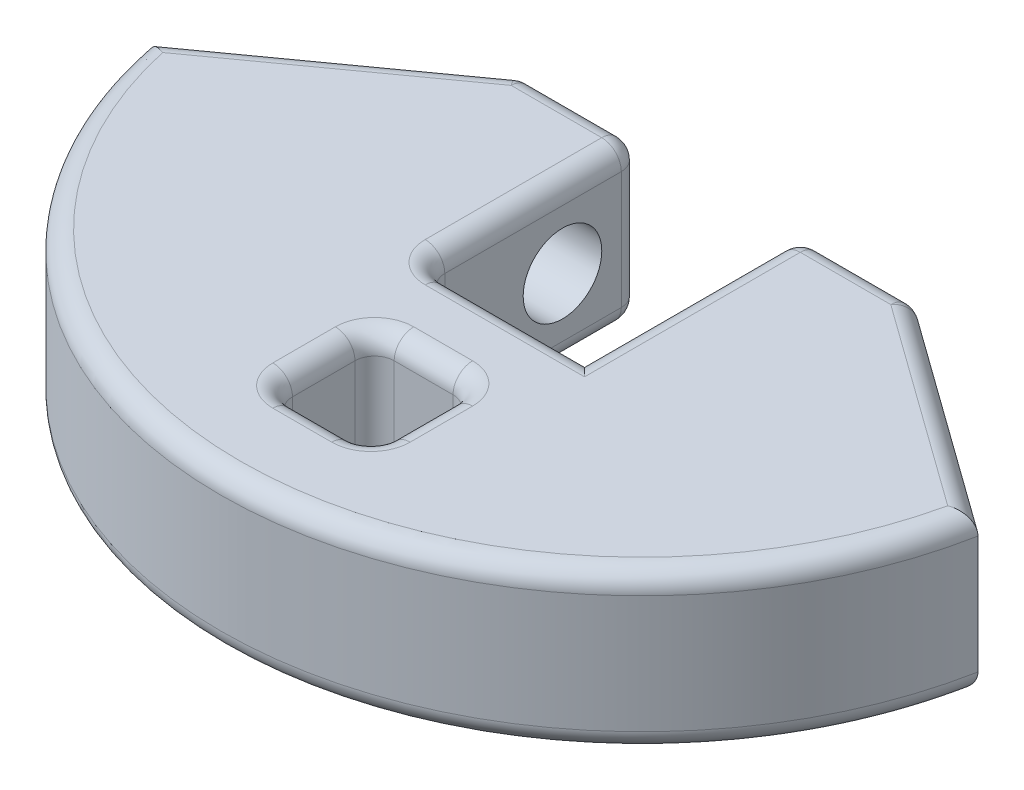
ISO-10303-21;
HEADER;
FILE_DESCRIPTION(('STEP AP214'),'2;1');
FILE_NAME('part.step','',(''),(''),'','','');
FILE_SCHEMA(('AUTOMOTIVE_DESIGN { 1 0 10303 214 1 1 1 1 }'));
ENDSEC;
DATA;
#1=APPLICATION_CONTEXT('core data for automotive mechanical design processes');
#2=APPLICATION_PROTOCOL_DEFINITION('international standard','automotive_design',2000,#1);
#3=PRODUCT_CONTEXT('',#1,'mechanical');
#4=PRODUCT('Part','Part','',(#3));
#5=PRODUCT_RELATED_PRODUCT_CATEGORY('part','',(#4));
#6=PRODUCT_DEFINITION_FORMATION('','',#4);
#7=PRODUCT_DEFINITION_CONTEXT('part definition',#1,'design');
#8=PRODUCT_DEFINITION('design','',#6,#7);
#9=PRODUCT_DEFINITION_SHAPE('','',#8);
#10=(LENGTH_UNIT() NAMED_UNIT(*) SI_UNIT(.MILLI.,.METRE.));
#11=(NAMED_UNIT(*) PLANE_ANGLE_UNIT() SI_UNIT($,.RADIAN.));
#12=(NAMED_UNIT(*) SI_UNIT($,.STERADIAN.) SOLID_ANGLE_UNIT());
#13=UNCERTAINTY_MEASURE_WITH_UNIT(LENGTH_MEASURE(1.E-05),#10,'distance_accuracy_value','');
#14=(GEOMETRIC_REPRESENTATION_CONTEXT(3) GLOBAL_UNCERTAINTY_ASSIGNED_CONTEXT((#13)) GLOBAL_UNIT_ASSIGNED_CONTEXT((#10,
#11,#12)) REPRESENTATION_CONTEXT('',''));
#15=CARTESIAN_POINT('',(0.,0.,0.));
#16=DIRECTION('',(0.,0.,1.));
#17=DIRECTION('',(1.,0.,0.));
#18=AXIS2_PLACEMENT_3D('',#15,#16,#17);
#19=CARTESIAN_POINT('',(0.,-6.35,0.));
#20=DIRECTION('',(0.,1.,0.));
#21=DIRECTION('',(0.,0.,1.));
#22=AXIS2_PLACEMENT_3D('',#19,#20,#21);
#23=PLANE('',#22);
#24=CARTESIAN_POINT('',(-4.86171875,-6.35,9.525));
#25=DIRECTION('',(0.,1.,0.));
#26=DIRECTION('',(0.,0.,1.));
#27=AXIS2_PLACEMENT_3D('',#24,#25,#26);
#28=CIRCLE('',#27,3.175);
#29=CARTESIAN_POINT('',(-4.86171875,-6.35,12.7));
#30=VERTEX_POINT('',#29);
#31=CARTESIAN_POINT('',(-8.03671875,-6.35,9.525));
#32=VERTEX_POINT('',#31);
#33=EDGE_CURVE('E377',#30,#32,#28,.F.);
#34=ORIENTED_EDGE('',*,*,#33,.F.);
#35=DIRECTION('',(-1.,0.,0.));
#36=VECTOR('',#35,1.);
#37=CARTESIAN_POINT('',(0.,-6.35,12.7));
#38=LINE('',#37,#36);
#39=CARTESIAN_POINT('',(8.03671875,-6.35,12.7));
#40=VERTEX_POINT('',#39);
#41=EDGE_CURVE('E380',#30,#40,#38,.F.);
#42=ORIENTED_EDGE('',*,*,#41,.T.);
#43=DIRECTION('',(0.,0.,1.));
#44=VECTOR('',#43,1.);
#45=CARTESIAN_POINT('',(8.03671875,-6.35,0.));
#46=LINE('',#45,#44);
#47=CARTESIAN_POINT('',(8.03671875,-6.35,-4.7625));
#48=VERTEX_POINT('',#47);
#49=EDGE_CURVE('E374',#40,#48,#46,.F.);
#50=ORIENTED_EDGE('',*,*,#49,.T.);
#51=DIRECTION('',(-1.,0.,0.));
#52=VECTOR('',#51,1.);
#53=CARTESIAN_POINT('',(0.,-6.35,-4.7625));
#54=LINE('',#53,#52);
#55=CARTESIAN_POINT('',(15.36346199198,-6.35,-4.7625));
#56=VERTEX_POINT('',#55);
#57=EDGE_CURVE('E362',#48,#56,#54,.F.);
#58=ORIENTED_EDGE('',*,*,#57,.T.);
#59=DIRECTION('',(0.811871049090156,0.,0.58383679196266));
#60=VECTOR('',#59,1.);
#61=CARTESIAN_POINT('',(7.49429851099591,-6.35,-10.4214124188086));
#62=LINE('',#61,#60);
#63=CARTESIAN_POINT('',(31.7735233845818,-6.35,7.0383858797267));
#64=VERTEX_POINT('',#63);
#65=EDGE_CURVE('E364',#56,#64,#62,.T.);
#66=ORIENTED_EDGE('',*,*,#65,.T.);
#67=CARTESIAN_POINT('',(0.,-6.35,0.));
#68=DIRECTION('',(0.,1.,0.));
#69=DIRECTION('',(0.,0.,1.));
#70=AXIS2_PLACEMENT_3D('',#67,#68,#69);
#71=CIRCLE('',#70,32.54375);
#72=CARTESIAN_POINT('',(-31.7735233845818,-6.35,7.0383858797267));
#73=VERTEX_POINT('',#72);
#74=EDGE_CURVE('E366',#64,#73,#71,.F.);
#75=ORIENTED_EDGE('',*,*,#74,.T.);
#76=DIRECTION('',(0.811871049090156,0.,-0.58383679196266));
#77=VECTOR('',#76,1.);
#78=CARTESIAN_POINT('',(-7.49429851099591,-6.35,-10.4214124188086));
#79=LINE('',#78,#77);
#80=CARTESIAN_POINT('',(-15.36346199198,-6.35,-4.7625));
#81=VERTEX_POINT('',#80);
#82=EDGE_CURVE('E368',#73,#81,#79,.T.);
#83=ORIENTED_EDGE('',*,*,#82,.T.);
#84=DIRECTION('',(-1.,0.,0.));
#85=VECTOR('',#84,1.);
#86=CARTESIAN_POINT('',(0.,-6.35,-4.7625));
#87=LINE('',#86,#85);
#88=CARTESIAN_POINT('',(-8.03671875,-6.35,-4.7625));
#89=VERTEX_POINT('',#88);
#90=EDGE_CURVE('E370',#81,#89,#87,.F.);
#91=ORIENTED_EDGE('',*,*,#90,.T.);
#92=DIRECTION('',(0.,0.,-1.));
#93=VECTOR('',#92,1.);
#94=CARTESIAN_POINT('',(-8.03671875,-6.35,0.));
#95=LINE('',#94,#93);
#96=EDGE_CURVE('E372',#89,#32,#95,.F.);
#97=ORIENTED_EDGE('',*,*,#96,.T.);
#98=EDGE_LOOP('',(#34,#42,#50,#58,#66,#75,#83,#91,#97));
#99=FACE_BOUND('',#98,.T.);
#100=CARTESIAN_POINT('',(2.38125,-6.35,19.2783766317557));
#101=DIRECTION('',(0.,1.,0.));
#102=DIRECTION('',(0.,0.,1.));
#103=AXIS2_PLACEMENT_3D('',#100,#101,#102);
#104=CIRCLE('',#103,3.175);
#105=CARTESIAN_POINT('',(2.38125,-6.35,16.1033766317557));
#106=VERTEX_POINT('',#105);
#107=CARTESIAN_POINT('',(5.55625,-6.35,19.2783766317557));
#108=VERTEX_POINT('',#107);
#109=EDGE_CURVE('E860',#106,#108,#104,.F.);
#110=ORIENTED_EDGE('',*,*,#109,.F.);
#111=DIRECTION('',(1.,0.,0.));
#112=VECTOR('',#111,1.);
#113=CARTESIAN_POINT('',(0.,-6.35,16.1033766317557));
#114=LINE('',#113,#112);
#115=CARTESIAN_POINT('',(-2.38125,-6.35,16.1033766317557));
#116=VERTEX_POINT('',#115);
#117=EDGE_CURVE('E858',#106,#116,#114,.F.);
#118=ORIENTED_EDGE('',*,*,#117,.T.);
#119=CARTESIAN_POINT('',(-2.38125,-6.35,19.2783766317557));
#120=DIRECTION('',(0.,1.,0.));
#121=DIRECTION('',(0.,0.,1.));
#122=AXIS2_PLACEMENT_3D('',#119,#120,#121);
#123=CIRCLE('',#122,3.175);
#124=CARTESIAN_POINT('',(-5.55625,-6.35,19.2783766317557));
#125=VERTEX_POINT('',#124);
#126=EDGE_CURVE('E855',#125,#116,#123,.F.);
#127=ORIENTED_EDGE('',*,*,#126,.F.);
#128=DIRECTION('',(0.,0.,-1.));
#129=VECTOR('',#128,1.);
#130=CARTESIAN_POINT('',(-5.55625,-6.35,25.9233233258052));
#131=LINE('',#130,#129);
#132=CARTESIAN_POINT('',(-5.55625,-6.35,24.3358233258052));
#133=VERTEX_POINT('',#132);
#134=EDGE_CURVE('E852',#125,#133,#131,.F.);
#135=ORIENTED_EDGE('',*,*,#134,.T.);
#136=CARTESIAN_POINT('',(-2.38125,-6.35,24.3358233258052));
#137=DIRECTION('',(0.,1.,0.));
#138=DIRECTION('',(0.,0.,1.));
#139=AXIS2_PLACEMENT_3D('',#136,#137,#138);
#140=CIRCLE('',#139,3.175);
#141=CARTESIAN_POINT('',(-2.38125,-6.35,27.5108233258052));
#142=VERTEX_POINT('',#141);
#143=EDGE_CURVE('E850',#142,#133,#140,.F.);
#144=ORIENTED_EDGE('',*,*,#143,.F.);
#145=DIRECTION('',(1.,0.,0.));
#146=VECTOR('',#145,1.);
#147=CARTESIAN_POINT('',(0.,-6.35,27.5108233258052));
#148=LINE('',#147,#146);
#149=CARTESIAN_POINT('',(2.38125,-6.35,27.5108233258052));
#150=VERTEX_POINT('',#149);
#151=EDGE_CURVE('E846',#142,#150,#148,.T.);
#152=ORIENTED_EDGE('',*,*,#151,.T.);
#153=CARTESIAN_POINT('',(2.38125,-6.35,24.3358233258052));
#154=DIRECTION('',(0.,1.,0.));
#155=DIRECTION('',(0.,0.,1.));
#156=AXIS2_PLACEMENT_3D('',#153,#154,#155);
#157=CIRCLE('',#156,3.175);
#158=CARTESIAN_POINT('',(5.55625,-6.35,24.3358233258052));
#159=VERTEX_POINT('',#158);
#160=EDGE_CURVE('E843',#159,#150,#157,.F.);
#161=ORIENTED_EDGE('',*,*,#160,.F.);
#162=DIRECTION('',(0.,0.,-1.));
#163=VECTOR('',#162,1.);
#164=CARTESIAN_POINT('',(5.55625,-6.35,0.));
#165=LINE('',#164,#163);
#166=EDGE_CURVE('E848',#159,#108,#165,.T.);
#167=ORIENTED_EDGE('',*,*,#166,.T.);
#168=EDGE_LOOP('',(#110,#118,#127,#135,#144,#152,#161,#167));
#169=FACE_BOUND('',#168,.T.);
#170=ADVANCED_FACE('F33',(#99,#169),#23,.F.);
#171=CARTESIAN_POINT('',(0.,6.35,0.));
#172=DIRECTION('',(0.,1.,0.));
#173=DIRECTION('',(0.,0.,1.));
#174=AXIS2_PLACEMENT_3D('',#171,#172,#173);
#175=PLANE('',#174);
#176=DIRECTION('',(-1.,0.,0.));
#177=VECTOR('',#176,1.);
#178=CARTESIAN_POINT('',(-15.875,6.35,-4.7625));
#179=LINE('',#178,#177);
#180=CARTESIAN_POINT('',(-8.03671875,6.35,-4.7625));
#181=VERTEX_POINT('',#180);
#182=CARTESIAN_POINT('',(-15.36346199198,6.35,-4.7625));
#183=VERTEX_POINT('',#182);
#184=EDGE_CURVE('E408',#181,#183,#179,.T.);
#185=ORIENTED_EDGE('',*,*,#184,.T.);
#186=DIRECTION('',(0.811871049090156,0.,-0.58383679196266));
#187=VECTOR('',#186,1.);
#188=CARTESIAN_POINT('',(-32.608509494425,6.35,7.63884529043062));
#189=LINE('',#188,#187);
#190=CARTESIAN_POINT('',(-31.7735233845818,6.35,7.0383858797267));
#191=VERTEX_POINT('',#190);
#192=EDGE_CURVE('E410',#183,#191,#189,.F.);
#193=ORIENTED_EDGE('',*,*,#192,.T.);
#194=CARTESIAN_POINT('',(0.,6.35,0.));
#195=DIRECTION('',(0.,1.,0.));
#196=DIRECTION('',(0.,0.,1.));
#197=AXIS2_PLACEMENT_3D('',#194,#195,#196);
#198=CIRCLE('',#197,32.54375);
#199=CARTESIAN_POINT('',(31.7735233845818,6.35,7.0383858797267));
#200=VERTEX_POINT('',#199);
#201=EDGE_CURVE('E400',#191,#200,#198,.T.);
#202=ORIENTED_EDGE('',*,*,#201,.T.);
#203=DIRECTION('',(0.811871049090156,0.,0.58383679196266));
#204=VECTOR('',#203,1.);
#205=CARTESIAN_POINT('',(14.9481590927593,6.35,-5.06115470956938));
#206=LINE('',#205,#204);
#207=CARTESIAN_POINT('',(15.36346199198,6.35,-4.7625));
#208=VERTEX_POINT('',#207);
#209=EDGE_CURVE('E392',#200,#208,#206,.F.);
#210=ORIENTED_EDGE('',*,*,#209,.T.);
#211=DIRECTION('',(-1.,0.,0.));
#212=VECTOR('',#211,1.);
#213=CARTESIAN_POINT('',(6.44921875,6.35,-4.7625));
#214=LINE('',#213,#212);
#215=CARTESIAN_POINT('',(8.03671875,6.35,-4.7625));
#216=VERTEX_POINT('',#215);
#217=EDGE_CURVE('E394',#208,#216,#214,.T.);
#218=ORIENTED_EDGE('',*,*,#217,.T.);
#219=DIRECTION('',(0.,0.,1.));
#220=VECTOR('',#219,1.);
#221=CARTESIAN_POINT('',(8.03671875,6.35,11.1125));
#222=LINE('',#221,#220);
#223=CARTESIAN_POINT('',(8.03671875,6.35,12.7));
#224=VERTEX_POINT('',#223);
#225=EDGE_CURVE('E396',#216,#224,#222,.T.);
#226=ORIENTED_EDGE('',*,*,#225,.T.);
#227=DIRECTION('',(-1.,0.,0.));
#228=VECTOR('',#227,1.);
#229=CARTESIAN_POINT('',(-6.44921875,6.35,12.7));
#230=LINE('',#229,#228);
#231=CARTESIAN_POINT('',(-4.86171875,6.35,12.7));
#232=VERTEX_POINT('',#231);
#233=EDGE_CURVE('E398',#224,#232,#230,.T.);
#234=ORIENTED_EDGE('',*,*,#233,.T.);
#235=CARTESIAN_POINT('',(-4.86171875,6.35,9.525));
#236=DIRECTION('',(0.,1.,0.));
#237=DIRECTION('',(0.,0.,1.));
#238=AXIS2_PLACEMENT_3D('',#235,#236,#237);
#239=CIRCLE('',#238,3.175);
#240=CARTESIAN_POINT('',(-8.03671875,6.35,9.525));
#241=VERTEX_POINT('',#240);
#242=EDGE_CURVE('E403',#241,#232,#239,.T.);
#243=ORIENTED_EDGE('',*,*,#242,.F.);
#244=DIRECTION('',(0.,0.,-1.));
#245=VECTOR('',#244,1.);
#246=CARTESIAN_POINT('',(-8.03671875,6.35,-6.35));
#247=LINE('',#246,#245);
#248=EDGE_CURVE('E406',#241,#181,#247,.T.);
#249=ORIENTED_EDGE('',*,*,#248,.T.);
#250=EDGE_LOOP('',(#185,#193,#202,#210,#218,#226,#234,#243,#249));
#251=FACE_BOUND('',#250,.T.);
#252=CARTESIAN_POINT('',(-2.38125,6.35,19.2783766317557));
#253=DIRECTION('',(0.,1.,0.));
#254=DIRECTION('',(0.,0.,1.));
#255=AXIS2_PLACEMENT_3D('',#252,#253,#254);
#256=CIRCLE('',#255,3.175);
#257=CARTESIAN_POINT('',(-2.38125,6.35,16.1033766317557));
#258=VERTEX_POINT('',#257);
#259=CARTESIAN_POINT('',(-5.55625,6.35,19.2783766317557));
#260=VERTEX_POINT('',#259);
#261=EDGE_CURVE('E831',#258,#260,#256,.T.);
#262=ORIENTED_EDGE('',*,*,#261,.F.);
#263=DIRECTION('',(1.,0.,0.));
#264=VECTOR('',#263,1.);
#265=CARTESIAN_POINT('',(3.96875,6.35,16.1033766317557));
#266=LINE('',#265,#264);
#267=CARTESIAN_POINT('',(2.38125,6.35,16.1033766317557));
#268=VERTEX_POINT('',#267);
#269=EDGE_CURVE('E829',#258,#268,#266,.T.);
#270=ORIENTED_EDGE('',*,*,#269,.T.);
#271=CARTESIAN_POINT('',(2.38125,6.35,19.2783766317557));
#272=DIRECTION('',(0.,1.,0.));
#273=DIRECTION('',(0.,0.,1.));
#274=AXIS2_PLACEMENT_3D('',#271,#272,#273);
#275=CIRCLE('',#274,3.175);
#276=CARTESIAN_POINT('',(5.55625,6.35,19.2783766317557));
#277=VERTEX_POINT('',#276);
#278=EDGE_CURVE('E826',#277,#268,#275,.T.);
#279=ORIENTED_EDGE('',*,*,#278,.F.);
#280=DIRECTION('',(0.,0.,1.));
#281=VECTOR('',#280,1.);
#282=CARTESIAN_POINT('',(5.55625,6.35,25.9233233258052));
#283=LINE('',#282,#281);
#284=CARTESIAN_POINT('',(5.55625,6.35,24.3358233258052));
#285=VERTEX_POINT('',#284);
#286=EDGE_CURVE('E821',#277,#285,#283,.T.);
#287=ORIENTED_EDGE('',*,*,#286,.T.);
#288=CARTESIAN_POINT('',(2.38125,6.35,24.3358233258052));
#289=DIRECTION('',(0.,1.,0.));
#290=DIRECTION('',(0.,0.,1.));
#291=AXIS2_PLACEMENT_3D('',#288,#289,#290);
#292=CIRCLE('',#291,3.175);
#293=CARTESIAN_POINT('',(2.38125,6.35,27.5108233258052));
#294=VERTEX_POINT('',#293);
#295=EDGE_CURVE('E818',#294,#285,#292,.T.);
#296=ORIENTED_EDGE('',*,*,#295,.F.);
#297=DIRECTION('',(1.,0.,0.));
#298=VECTOR('',#297,1.);
#299=CARTESIAN_POINT('',(-3.96875,6.35,27.5108233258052));
#300=LINE('',#299,#298);
#301=CARTESIAN_POINT('',(-2.38125,6.35,27.5108233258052));
#302=VERTEX_POINT('',#301);
#303=EDGE_CURVE('E816',#294,#302,#300,.F.);
#304=ORIENTED_EDGE('',*,*,#303,.T.);
#305=CARTESIAN_POINT('',(-2.38125,6.35,24.3358233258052));
#306=DIRECTION('',(0.,1.,0.));
#307=DIRECTION('',(0.,0.,1.));
#308=AXIS2_PLACEMENT_3D('',#305,#306,#307);
#309=CIRCLE('',#308,3.175);
#310=CARTESIAN_POINT('',(-5.55625,6.35,24.3358233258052));
#311=VERTEX_POINT('',#310);
#312=EDGE_CURVE('E813',#311,#302,#309,.T.);
#313=ORIENTED_EDGE('',*,*,#312,.F.);
#314=DIRECTION('',(0.,0.,1.));
#315=VECTOR('',#314,1.);
#316=CARTESIAN_POINT('',(-5.55625,6.35,0.));
#317=LINE('',#316,#315);
#318=EDGE_CURVE('E823',#311,#260,#317,.F.);
#319=ORIENTED_EDGE('',*,*,#318,.T.);
#320=EDGE_LOOP('',(#262,#270,#279,#287,#296,#304,#313,#319));
#321=FACE_BOUND('',#320,.T.);
#322=ADVANCED_FACE('F635',(#251,#321),#175,.T.);
#323=CARTESIAN_POINT('',(0.,6.35,0.));
#324=DIRECTION('',(0.,-1.,0.));
#325=DIRECTION('',(0.,0.,-1.));
#326=AXIS2_PLACEMENT_3D('',#323,#324,#325);
#327=CYLINDRICAL_SURFACE('',#326,34.13125);
#328=DIRECTION('',(0.,1.,0.));
#329=VECTOR('',#328,1.);
#330=CARTESIAN_POINT('',(-33.5353504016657,-6.35,6.35));
#331=LINE('',#330,#329);
#332=CARTESIAN_POINT('',(-33.5353504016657,-4.7625,6.35));
#333=VERTEX_POINT('',#332);
#334=CARTESIAN_POINT('',(-33.5353504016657,4.7625,6.35));
#335=VERTEX_POINT('',#334);
#336=EDGE_CURVE('E774',#333,#335,#331,.T.);
#337=ORIENTED_EDGE('',*,*,#336,.F.);
#338=CARTESIAN_POINT('',(0.,-4.7625,0.));
#339=DIRECTION('',(0.,1.,0.));
#340=DIRECTION('',(0.,0.,1.));
#341=AXIS2_PLACEMENT_3D('',#338,#339,#340);
#342=CIRCLE('',#341,34.13125);
#343=CARTESIAN_POINT('',(33.5353504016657,-4.7625,6.35));
#344=VERTEX_POINT('',#343);
#345=EDGE_CURVE('E390',#333,#344,#342,.T.);
#346=ORIENTED_EDGE('',*,*,#345,.T.);
#347=DIRECTION('',(0.,1.,0.));
#348=VECTOR('',#347,1.);
#349=CARTESIAN_POINT('',(33.5353504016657,-6.35,6.35));
#350=LINE('',#349,#348);
#351=CARTESIAN_POINT('',(33.5353504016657,4.7625,6.35));
#352=VERTEX_POINT('',#351);
#353=EDGE_CURVE('E319',#344,#352,#350,.T.);
#354=ORIENTED_EDGE('',*,*,#353,.T.);
#355=CARTESIAN_POINT('',(0.,4.7625,0.));
#356=DIRECTION('',(0.,1.,0.));
#357=DIRECTION('',(0.,0.,1.));
#358=AXIS2_PLACEMENT_3D('',#355,#356,#357);
#359=CIRCLE('',#358,34.13125);
#360=EDGE_CURVE('E388',#352,#335,#359,.F.);
#361=ORIENTED_EDGE('',*,*,#360,.T.);
#362=EDGE_LOOP('',(#337,#346,#354,#361));
#363=FACE_BOUND('',#362,.T.);
#364=ADVANCED_FACE('F641',(#363),#327,.T.);
#365=CARTESIAN_POINT('',(6.44921875,6.35,-6.35));
#366=DIRECTION('',(0.,0.,1.));
#367=DIRECTION('',(1.,0.,0.));
#368=AXIS2_PLACEMENT_3D('',#365,#366,#367);
#369=PLANE('',#368);
#370=DIRECTION('',(0.,1.,0.));
#371=VECTOR('',#370,1.);
#372=CARTESIAN_POINT('',(15.36346199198,6.35,-6.35));
#373=LINE('',#372,#371);
#374=CARTESIAN_POINT('',(15.36346199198,4.7625,-6.35));
#375=VERTEX_POINT('',#374);
#376=CARTESIAN_POINT('',(15.36346199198,-4.7625,-6.35));
#377=VERTEX_POINT('',#376);
#378=EDGE_CURVE('E349',#375,#377,#373,.F.);
#379=ORIENTED_EDGE('',*,*,#378,.T.);
#380=DIRECTION('',(-1.,0.,0.));
#381=VECTOR('',#380,1.);
#382=CARTESIAN_POINT('',(6.44921875,-4.7625,-6.35));
#383=LINE('',#382,#381);
#384=CARTESIAN_POINT('',(8.03671875,-4.7625,-6.35));
#385=VERTEX_POINT('',#384);
#386=EDGE_CURVE('E354',#377,#385,#383,.T.);
#387=ORIENTED_EDGE('',*,*,#386,.T.);
#388=DIRECTION('',(0.,-1.,0.));
#389=VECTOR('',#388,1.);
#390=CARTESIAN_POINT('',(8.03671875,6.35,-6.35));
#391=LINE('',#390,#389);
#392=CARTESIAN_POINT('',(8.03671875,4.7625,-6.35));
#393=VERTEX_POINT('',#392);
#394=EDGE_CURVE('E351',#385,#393,#391,.F.);
#395=ORIENTED_EDGE('',*,*,#394,.T.);
#396=DIRECTION('',(-1.,0.,0.));
#397=VECTOR('',#396,1.);
#398=CARTESIAN_POINT('',(15.875,4.7625,-6.35));
#399=LINE('',#398,#397);
#400=EDGE_CURVE('E347',#393,#375,#399,.F.);
#401=ORIENTED_EDGE('',*,*,#400,.T.);
#402=EDGE_LOOP('',(#379,#387,#395,#401));
#403=FACE_BOUND('',#402,.T.);
#404=ADVANCED_FACE('F661',(#403),#369,.F.);
#405=CARTESIAN_POINT('',(6.44921875,6.35,11.1125));
#406=DIRECTION('',(1.,0.,0.));
#407=DIRECTION('',(0.,0.,-1.));
#408=AXIS2_PLACEMENT_3D('',#405,#406,#407);
#409=PLANE('',#408);
#410=CARTESIAN_POINT('',(6.44921875,0.,0.));
#411=DIRECTION('',(1.,0.,0.));
#412=DIRECTION('',(0.,0.,-1.));
#413=AXIS2_PLACEMENT_3D('',#410,#411,#412);
#414=CIRCLE('',#413,3.18135);
#415=CARTESIAN_POINT('',(6.44921875,0.,-3.18135));
#416=VERTEX_POINT('',#415);
#417=EDGE_CURVE('E776',#416,#416,#414,.T.);
#418=ORIENTED_EDGE('',*,*,#417,.T.);
#419=EDGE_LOOP('',(#418));
#420=FACE_BOUND('',#419,.T.);
#421=DIRECTION('',(0.,-1.,0.));
#422=VECTOR('',#421,1.);
#423=CARTESIAN_POINT('',(6.44921875,6.35,-4.7625));
#424=LINE('',#423,#422);
#425=CARTESIAN_POINT('',(6.44921875,4.7625,-4.7625));
#426=VERTEX_POINT('',#425);
#427=CARTESIAN_POINT('',(6.44921875,-4.7625,-4.7625));
#428=VERTEX_POINT('',#427);
#429=EDGE_CURVE('E342',#426,#428,#424,.T.);
#430=ORIENTED_EDGE('',*,*,#429,.T.);
#431=DIRECTION('',(0.,0.,1.));
#432=VECTOR('',#431,1.);
#433=CARTESIAN_POINT('',(6.44921875,-4.7625,11.1125));
#434=LINE('',#433,#432);
#435=CARTESIAN_POINT('',(6.44921875,-4.7625,11.1125));
#436=VERTEX_POINT('',#435);
#437=EDGE_CURVE('E345',#428,#436,#434,.T.);
#438=ORIENTED_EDGE('',*,*,#437,.T.);
#439=DIRECTION('',(0.,-1.,0.));
#440=VECTOR('',#439,1.);
#441=CARTESIAN_POINT('',(6.44921875,6.35,11.1125));
#442=LINE('',#441,#440);
#443=CARTESIAN_POINT('',(6.44921875,4.7625,11.1125));
#444=VERTEX_POINT('',#443);
#445=EDGE_CURVE('E316',#444,#436,#442,.T.);
#446=ORIENTED_EDGE('',*,*,#445,.F.);
#447=DIRECTION('',(0.,0.,1.));
#448=VECTOR('',#447,1.);
#449=CARTESIAN_POINT('',(6.44921875,4.7625,-6.35));
#450=LINE('',#449,#448);
#451=EDGE_CURVE('E340',#444,#426,#450,.F.);
#452=ORIENTED_EDGE('',*,*,#451,.T.);
#453=EDGE_LOOP('',(#430,#438,#446,#452));
#454=FACE_BOUND('',#453,.T.);
#455=ADVANCED_FACE('F657',(#420,#454),#409,.F.);
#456=CARTESIAN_POINT('',(-6.44921875,6.35,11.1125));
#457=DIRECTION('',(0.,0.,1.));
#458=DIRECTION('',(1.,0.,0.));
#459=AXIS2_PLACEMENT_3D('',#456,#457,#458);
#460=PLANE('',#459);
#461=ORIENTED_EDGE('',*,*,#445,.T.);
#462=DIRECTION('',(-1.,0.,0.));
#463=VECTOR('',#462,1.);
#464=CARTESIAN_POINT('',(-6.44921875,-4.7625,11.1125));
#465=LINE('',#464,#463);
#466=CARTESIAN_POINT('',(-4.86171875,-4.7625,11.1125));
#467=VERTEX_POINT('',#466);
#468=EDGE_CURVE('E386',#436,#467,#465,.T.);
#469=ORIENTED_EDGE('',*,*,#468,.T.);
#470=DIRECTION('',(0.,-1.,0.));
#471=VECTOR('',#470,1.);
#472=CARTESIAN_POINT('',(-4.86171875,6.35,11.1125));
#473=LINE('',#472,#471);
#474=CARTESIAN_POINT('',(-4.86171875,4.7625,11.1125));
#475=VERTEX_POINT('',#474);
#476=EDGE_CURVE('E382',#467,#475,#473,.F.);
#477=ORIENTED_EDGE('',*,*,#476,.T.);
#478=DIRECTION('',(-1.,0.,0.));
#479=VECTOR('',#478,1.);
#480=CARTESIAN_POINT('',(6.44921875,4.7625,11.1125));
#481=LINE('',#480,#479);
#482=EDGE_CURVE('E384',#475,#444,#481,.F.);
#483=ORIENTED_EDGE('',*,*,#482,.T.);
#484=EDGE_LOOP('',(#461,#469,#477,#483));
#485=FACE_BOUND('',#484,.T.);
#486=ADVANCED_FACE('F653',(#485),#460,.F.);
#487=CARTESIAN_POINT('',(-6.44921875,6.35,-6.35));
#488=DIRECTION('',(-1.,0.,0.));
#489=DIRECTION('',(0.,0.,1.));
#490=AXIS2_PLACEMENT_3D('',#487,#488,#489);
#491=PLANE('',#490);
#492=DIRECTION('',(0.,0.,-1.));
#493=VECTOR('',#492,1.);
#494=CARTESIAN_POINT('',(-6.44921875,-4.7625,-6.35));
#495=LINE('',#494,#493);
#496=CARTESIAN_POINT('',(-6.44921875,-4.7625,9.525));
#497=VERTEX_POINT('',#496);
#498=CARTESIAN_POINT('',(-6.44921875,-4.7625,-4.7625));
#499=VERTEX_POINT('',#498);
#500=EDGE_CURVE('E330',#497,#499,#495,.T.);
#501=ORIENTED_EDGE('',*,*,#500,.T.);
#502=DIRECTION('',(0.,-1.,0.));
#503=VECTOR('',#502,1.);
#504=CARTESIAN_POINT('',(-6.44921875,6.35,-4.7625));
#505=LINE('',#504,#503);
#506=CARTESIAN_POINT('',(-6.44921875,4.7625,-4.7625));
#507=VERTEX_POINT('',#506);
#508=EDGE_CURVE('E332',#499,#507,#505,.F.);
#509=ORIENTED_EDGE('',*,*,#508,.T.);
#510=DIRECTION('',(0.,0.,-1.));
#511=VECTOR('',#510,1.);
#512=CARTESIAN_POINT('',(-6.44921875,4.7625,11.1125));
#513=LINE('',#512,#511);
#514=CARTESIAN_POINT('',(-6.44921875,4.7625,9.525));
#515=VERTEX_POINT('',#514);
#516=EDGE_CURVE('E328',#507,#515,#513,.F.);
#517=ORIENTED_EDGE('',*,*,#516,.T.);
#518=DIRECTION('',(0.,-1.,0.));
#519=VECTOR('',#518,1.);
#520=CARTESIAN_POINT('',(-6.44921875,-6.35,9.525));
#521=LINE('',#520,#519);
#522=EDGE_CURVE('E326',#515,#497,#521,.T.);
#523=ORIENTED_EDGE('',*,*,#522,.T.);
#524=EDGE_LOOP('',(#501,#509,#517,#523));
#525=FACE_BOUND('',#524,.T.);
#526=CARTESIAN_POINT('',(-6.44921875,0.,0.));
#527=DIRECTION('',(-1.,0.,0.));
#528=DIRECTION('',(0.,0.,1.));
#529=AXIS2_PLACEMENT_3D('',#526,#527,#528);
#530=CIRCLE('',#529,3.18135);
#531=CARTESIAN_POINT('',(-6.44921875,0.,3.18135));
#532=VERTEX_POINT('',#531);
#533=EDGE_CURVE('E781',#532,#532,#530,.T.);
#534=ORIENTED_EDGE('',*,*,#533,.T.);
#535=EDGE_LOOP('',(#534));
#536=FACE_BOUND('',#535,.T.);
#537=ADVANCED_FACE('F650',(#525,#536),#491,.F.);
#538=CARTESIAN_POINT('',(-33.5353504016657,6.35,-6.35));
#539=DIRECTION('',(0.,0.,1.));
#540=DIRECTION('',(1.,0.,0.));
#541=AXIS2_PLACEMENT_3D('',#538,#539,#540);
#542=PLANE('',#541);
#543=DIRECTION('',(0.,-1.,0.));
#544=VECTOR('',#543,1.);
#545=CARTESIAN_POINT('',(-8.03671875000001,6.35,-6.35));
#546=LINE('',#545,#544);
#547=CARTESIAN_POINT('',(-8.03671875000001,4.7625,-6.35));
#548=VERTEX_POINT('',#547);
#549=CARTESIAN_POINT('',(-8.03671875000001,-4.7625,-6.35));
#550=VERTEX_POINT('',#549);
#551=EDGE_CURVE('E289',#548,#550,#546,.T.);
#552=ORIENTED_EDGE('',*,*,#551,.T.);
#553=DIRECTION('',(-1.,0.,0.));
#554=VECTOR('',#553,1.);
#555=CARTESIAN_POINT('',(-33.5353504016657,-4.7625,-6.35));
#556=LINE('',#555,#554);
#557=CARTESIAN_POINT('',(-15.36346199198,-4.7625,-6.35));
#558=VERTEX_POINT('',#557);
#559=EDGE_CURVE('E285',#550,#558,#556,.T.);
#560=ORIENTED_EDGE('',*,*,#559,.T.);
#561=DIRECTION('',(0.,1.,0.));
#562=VECTOR('',#561,1.);
#563=CARTESIAN_POINT('',(-15.36346199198,6.35,-6.35));
#564=LINE('',#563,#562);
#565=CARTESIAN_POINT('',(-15.36346199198,4.7625,-6.35));
#566=VERTEX_POINT('',#565);
#567=EDGE_CURVE('E277',#558,#566,#564,.T.);
#568=ORIENTED_EDGE('',*,*,#567,.T.);
#569=DIRECTION('',(-1.,0.,0.));
#570=VECTOR('',#569,1.);
#571=CARTESIAN_POINT('',(-6.44921875,4.7625,-6.35));
#572=LINE('',#571,#570);
#573=EDGE_CURVE('E282',#566,#548,#572,.F.);
#574=ORIENTED_EDGE('',*,*,#573,.T.);
#575=EDGE_LOOP('',(#552,#560,#568,#574));
#576=FACE_BOUND('',#575,.T.);
#577=ADVANCED_FACE('F280',(#576),#542,.F.);
#578=CARTESIAN_POINT('',(-15.875,-6.35,-6.35));
#579=DIRECTION('',(0.58383679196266,0.,0.811871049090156));
#580=DIRECTION('',(0.811871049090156,0.,-0.58383679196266));
#581=AXIS2_PLACEMENT_3D('',#578,#579,#580);
#582=PLANE('',#581);
#583=CARTESIAN_POINT('',(-24.7051752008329,0.,0.));
#584=DIRECTION('',(0.58383679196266,0.,0.811871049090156));
#585=DIRECTION('',(0.811871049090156,0.,-0.58383679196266));
#586=AXIS2_PLACEMENT_3D('',#583,#584,#585);
#587=ELLIPSE('',#586,5.44903994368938,3.18135);
#588=CARTESIAN_POINT('',(-20.2812574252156,0.,-3.18135));
#589=VERTEX_POINT('',#588);
#590=EDGE_CURVE('E786',#589,#589,#587,.T.);
#591=ORIENTED_EDGE('',*,*,#590,.T.);
#592=EDGE_LOOP('',(#591));
#593=FACE_BOUND('',#592,.T.);
#594=DIRECTION('',(0.,1.,0.));
#595=VECTOR('',#594,1.);
#596=CARTESIAN_POINT('',(-16.2903028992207,-6.35,-6.05134529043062));
#597=LINE('',#596,#595);
#598=CARTESIAN_POINT('',(-16.2903028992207,4.7625,-6.05134529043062));
#599=VERTEX_POINT('',#598);
#600=CARTESIAN_POINT('',(-16.2903028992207,-4.7625,-6.05134529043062));
#601=VERTEX_POINT('',#600);
#602=EDGE_CURVE('E297',#599,#601,#597,.F.);
#603=ORIENTED_EDGE('',*,*,#602,.T.);
#604=DIRECTION('',(0.811871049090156,0.,-0.58383679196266));
#605=VECTOR('',#604,1.);
#606=CARTESIAN_POINT('',(-15.875,-4.7625,-6.35));
#607=LINE('',#606,#605);
#608=EDGE_CURVE('E338',#601,#333,#607,.F.);
#609=ORIENTED_EDGE('',*,*,#608,.T.);
#610=ORIENTED_EDGE('',*,*,#336,.T.);
#611=DIRECTION('',(0.811871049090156,0.,-0.58383679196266));
#612=VECTOR('',#611,1.);
#613=CARTESIAN_POINT('',(-15.875,4.7625,-6.35));
#614=LINE('',#613,#612);
#615=EDGE_CURVE('E335',#335,#599,#614,.T.);
#616=ORIENTED_EDGE('',*,*,#615,.T.);
#617=EDGE_LOOP('',(#603,#609,#610,#616));
#618=FACE_BOUND('',#617,.T.);
#619=ADVANCED_FACE('F649',(#593,#618),#582,.F.);
#620=CARTESIAN_POINT('',(15.875,-6.35,-6.35));
#621=DIRECTION('',(-0.58383679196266,0.,0.811871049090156));
#622=DIRECTION('',(0.811871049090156,0.,0.58383679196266));
#623=AXIS2_PLACEMENT_3D('',#620,#621,#622);
#624=PLANE('',#623);
#625=CARTESIAN_POINT('',(24.7051752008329,0.,0.));
#626=DIRECTION('',(-0.58383679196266,0.,0.811871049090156));
#627=DIRECTION('',(0.811871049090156,0.,0.58383679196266));
#628=AXIS2_PLACEMENT_3D('',#625,#626,#627);
#629=ELLIPSE('',#628,5.44903994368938,3.18135);
#630=CARTESIAN_POINT('',(29.1290929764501,0.,3.18135));
#631=VERTEX_POINT('',#630);
#632=EDGE_CURVE('E322',#631,#631,#629,.T.);
#633=ORIENTED_EDGE('',*,*,#632,.T.);
#634=EDGE_LOOP('',(#633));
#635=FACE_BOUND('',#634,.T.);
#636=ORIENTED_EDGE('',*,*,#353,.F.);
#637=DIRECTION('',(0.811871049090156,0.,0.58383679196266));
#638=VECTOR('',#637,1.);
#639=CARTESIAN_POINT('',(15.875,-4.7625,-6.35));
#640=LINE('',#639,#638);
#641=CARTESIAN_POINT('',(16.2903028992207,-4.7625,-6.05134529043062));
#642=VERTEX_POINT('',#641);
#643=EDGE_CURVE('E360',#344,#642,#640,.F.);
#644=ORIENTED_EDGE('',*,*,#643,.T.);
#645=DIRECTION('',(0.,1.,0.));
#646=VECTOR('',#645,1.);
#647=CARTESIAN_POINT('',(16.2903028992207,-6.35,-6.05134529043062));
#648=LINE('',#647,#646);
#649=CARTESIAN_POINT('',(16.2903028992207,4.7625,-6.05134529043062));
#650=VERTEX_POINT('',#649);
#651=EDGE_CURVE('E358',#642,#650,#648,.T.);
#652=ORIENTED_EDGE('',*,*,#651,.T.);
#653=DIRECTION('',(0.811871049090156,0.,0.58383679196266));
#654=VECTOR('',#653,1.);
#655=CARTESIAN_POINT('',(33.5353504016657,4.7625,6.35));
#656=LINE('',#655,#654);
#657=EDGE_CURVE('E356',#650,#352,#656,.T.);
#658=ORIENTED_EDGE('',*,*,#657,.T.);
#659=EDGE_LOOP('',(#636,#644,#652,#658));
#660=FACE_BOUND('',#659,.T.);
#661=ADVANCED_FACE('F998',(#635,#660),#624,.F.);
#662=CARTESIAN_POINT('',(-33.5353504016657,0.,0.));
#663=DIRECTION('',(1.,0.,0.));
#664=DIRECTION('',(0.,0.,-1.));
#665=AXIS2_PLACEMENT_3D('',#662,#663,#664);
#666=CYLINDRICAL_SURFACE('',#665,3.18135);
#667=ORIENTED_EDGE('',*,*,#632,.F.);
#668=EDGE_LOOP('',(#667));
#669=FACE_BOUND('',#668,.T.);
#670=ORIENTED_EDGE('',*,*,#417,.F.);
#671=EDGE_LOOP('',(#670));
#672=FACE_BOUND('',#671,.T.);
#673=ADVANCED_FACE('F995',(#669,#672),#666,.F.);
#674=ORIENTED_EDGE('',*,*,#590,.F.);
#675=EDGE_LOOP('',(#674));
#676=FACE_BOUND('',#675,.T.);
#677=ORIENTED_EDGE('',*,*,#533,.F.);
#678=EDGE_LOOP('',(#677));
#679=FACE_BOUND('',#678,.T.);
#680=ADVANCED_FACE('F552',(#676,#679),#666,.F.);
#681=CARTESIAN_POINT('',(15.36346199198,-6.35,-4.7625));
#682=DIRECTION('',(0.,1.,0.));
#683=DIRECTION('',(0.,0.,1.));
#684=AXIS2_PLACEMENT_3D('',#681,#682,#683);
#685=CYLINDRICAL_SURFACE('',#684,1.5875);
#686=CARTESIAN_POINT('',(15.36346199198,-4.7625,-4.7625));
#687=DIRECTION('',(0.,-1.,0.));
#688=DIRECTION('',(0.,0.,-1.));
#689=AXIS2_PLACEMENT_3D('',#686,#687,#688);
#690=CIRCLE('',#689,1.5875);
#691=EDGE_CURVE('E801',#377,#642,#690,.T.);
#692=ORIENTED_EDGE('',*,*,#691,.F.);
#693=ORIENTED_EDGE('',*,*,#378,.F.);
#694=CARTESIAN_POINT('',(15.36346199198,4.7625,-4.7625));
#695=DIRECTION('',(0.,1.,0.));
#696=DIRECTION('',(0.,0.,1.));
#697=AXIS2_PLACEMENT_3D('',#694,#695,#696);
#698=CIRCLE('',#697,1.5875);
#699=EDGE_CURVE('E795',#650,#375,#698,.T.);
#700=ORIENTED_EDGE('',*,*,#699,.F.);
#701=ORIENTED_EDGE('',*,*,#651,.F.);
#702=EDGE_LOOP('',(#692,#693,#700,#701));
#703=FACE_BOUND('',#702,.T.);
#704=ADVANCED_FACE('F548',(#703),#685,.T.);
#705=CARTESIAN_POINT('',(0.,4.7625,-4.7625));
#706=DIRECTION('',(1.,0.,0.));
#707=DIRECTION('',(0.,0.,-1.));
#708=AXIS2_PLACEMENT_3D('',#705,#706,#707);
#709=CYLINDRICAL_SURFACE('',#708,1.5875);
#710=CARTESIAN_POINT('',(15.36346199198,4.7625,-4.7625));
#711=DIRECTION('',(1.,0.,0.));
#712=DIRECTION('',(0.,0.,-1.));
#713=AXIS2_PLACEMENT_3D('',#710,#711,#712);
#714=CIRCLE('',#713,1.5875);
#715=EDGE_CURVE('E791',#375,#208,#714,.T.);
#716=ORIENTED_EDGE('',*,*,#715,.F.);
#717=ORIENTED_EDGE('',*,*,#400,.F.);
#718=CARTESIAN_POINT('',(8.03671875,4.7625,-4.7625));
#719=DIRECTION('',(-1.,0.,0.));
#720=DIRECTION('',(0.,0.,1.));
#721=AXIS2_PLACEMENT_3D('',#718,#719,#720);
#722=CIRCLE('',#721,1.5875);
#723=EDGE_CURVE('E1430',#216,#393,#722,.T.);
#724=ORIENTED_EDGE('',*,*,#723,.F.);
#725=ORIENTED_EDGE('',*,*,#217,.F.);
#726=EDGE_LOOP('',(#716,#717,#724,#725));
#727=FACE_BOUND('',#726,.T.);
#728=ADVANCED_FACE('F544',(#727),#709,.T.);
#729=CARTESIAN_POINT('',(15.36346199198,4.7625,-4.7625));
#730=DIRECTION('',(0.,1.,0.));
#731=DIRECTION('',(0.,0.,1.));
#732=AXIS2_PLACEMENT_3D('',#729,#730,#731);
#733=SPHERICAL_SURFACE('',#732,1.5875);
#734=ORIENTED_EDGE('',*,*,#699,.T.);
#735=ORIENTED_EDGE('',*,*,#715,.T.);
#736=CARTESIAN_POINT('',(15.36346199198,4.7625,-4.7625));
#737=DIRECTION('',(-0.811871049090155,0.,-0.583836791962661));
#738=DIRECTION('',(-0.583836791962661,0.,0.811871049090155));
#739=AXIS2_PLACEMENT_3D('',#736,#737,#738);
#740=CIRCLE('',#739,1.5875);
#741=EDGE_CURVE('E1432',#650,#208,#740,.F.);
#742=ORIENTED_EDGE('',*,*,#741,.F.);
#743=EDGE_LOOP('',(#734,#735,#742));
#744=FACE_BOUND('',#743,.T.);
#745=ADVANCED_FACE('F540',(#744),#733,.T.);
#746=CARTESIAN_POINT('',(15.36346199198,-4.7625,-4.7625));
#747=DIRECTION('',(0.,-1.,0.));
#748=DIRECTION('',(1.,0.,0.));
#749=AXIS2_PLACEMENT_3D('',#746,#747,#748);
#750=SPHERICAL_SURFACE('',#749,1.5875);
#751=CARTESIAN_POINT('',(15.36346199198,-4.7625,-4.7625));
#752=DIRECTION('',(-0.811871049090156,0.,-0.58383679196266));
#753=DIRECTION('',(-0.58383679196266,0.,0.811871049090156));
#754=AXIS2_PLACEMENT_3D('',#751,#752,#753);
#755=CIRCLE('',#754,1.5875);
#756=EDGE_CURVE('E1414',#56,#642,#755,.F.);
#757=ORIENTED_EDGE('',*,*,#756,.F.);
#758=CARTESIAN_POINT('',(15.36346199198,-4.7625,-4.7625));
#759=DIRECTION('',(1.,0.,0.));
#760=DIRECTION('',(0.,0.,-1.));
#761=AXIS2_PLACEMENT_3D('',#758,#759,#760);
#762=CIRCLE('',#761,1.5875);
#763=EDGE_CURVE('E1423',#377,#56,#762,.F.);
#764=ORIENTED_EDGE('',*,*,#763,.F.);
#765=ORIENTED_EDGE('',*,*,#691,.T.);
#766=EDGE_LOOP('',(#757,#764,#765));
#767=FACE_BOUND('',#766,.T.);
#768=ADVANCED_FACE('F536',(#767),#750,.T.);
#769=CARTESIAN_POINT('',(6.44921875,-4.7625,-4.7625));
#770=DIRECTION('',(-1.,0.,0.));
#771=DIRECTION('',(0.,0.,1.));
#772=AXIS2_PLACEMENT_3D('',#769,#770,#771);
#773=CYLINDRICAL_SURFACE('',#772,1.5875);
#774=ORIENTED_EDGE('',*,*,#763,.T.);
#775=ORIENTED_EDGE('',*,*,#57,.F.);
#776=CARTESIAN_POINT('',(8.03671875,-4.7625,-4.7625));
#777=DIRECTION('',(-1.,0.,0.));
#778=DIRECTION('',(0.,-1.,0.));
#779=AXIS2_PLACEMENT_3D('',#776,#777,#778);
#780=CIRCLE('',#779,1.5875);
#781=EDGE_CURVE('E1435',#385,#48,#780,.T.);
#782=ORIENTED_EDGE('',*,*,#781,.F.);
#783=ORIENTED_EDGE('',*,*,#386,.F.);
#784=EDGE_LOOP('',(#774,#775,#782,#783));
#785=FACE_BOUND('',#784,.T.);
#786=ADVANCED_FACE('F532',(#785),#773,.T.);
#787=CARTESIAN_POINT('',(8.03671875,6.35,-4.7625));
#788=DIRECTION('',(0.,-1.,0.));
#789=DIRECTION('',(0.,0.,-1.));
#790=AXIS2_PLACEMENT_3D('',#787,#788,#789);
#791=CYLINDRICAL_SURFACE('',#790,1.5875);
#792=CARTESIAN_POINT('',(8.03671875,4.7625,-4.7625));
#793=DIRECTION('',(0.,1.,0.));
#794=DIRECTION('',(0.,0.,1.));
#795=AXIS2_PLACEMENT_3D('',#792,#793,#794);
#796=CIRCLE('',#795,1.5875);
#797=EDGE_CURVE('E1425',#393,#426,#796,.T.);
#798=ORIENTED_EDGE('',*,*,#797,.F.);
#799=ORIENTED_EDGE('',*,*,#394,.F.);
#800=CARTESIAN_POINT('',(8.03671875,-4.7625,-4.7625));
#801=DIRECTION('',(0.,-1.,0.));
#802=DIRECTION('',(0.,0.,-1.));
#803=AXIS2_PLACEMENT_3D('',#800,#801,#802);
#804=CIRCLE('',#803,1.5875);
#805=EDGE_CURVE('E1436',#428,#385,#804,.T.);
#806=ORIENTED_EDGE('',*,*,#805,.F.);
#807=ORIENTED_EDGE('',*,*,#429,.F.);
#808=EDGE_LOOP('',(#798,#799,#806,#807));
#809=FACE_BOUND('',#808,.T.);
#810=ADVANCED_FACE('F528',(#809),#791,.T.);
#811=CARTESIAN_POINT('',(8.03671875,4.7625,-4.7625));
#812=DIRECTION('',(0.,0.,-1.));
#813=DIRECTION('',(-1.,0.,0.));
#814=AXIS2_PLACEMENT_3D('',#811,#812,#813);
#815=SPHERICAL_SURFACE('',#814,1.5875);
#816=ORIENTED_EDGE('',*,*,#723,.T.);
#817=ORIENTED_EDGE('',*,*,#797,.T.);
#818=CARTESIAN_POINT('',(8.03671875,4.7625,-4.7625));
#819=DIRECTION('',(0.,0.,-1.));
#820=DIRECTION('',(0.,1.,0.));
#821=AXIS2_PLACEMENT_3D('',#818,#819,#820);
#822=CIRCLE('',#821,1.5875);
#823=EDGE_CURVE('E502',#216,#426,#822,.F.);
#824=ORIENTED_EDGE('',*,*,#823,.F.);
#825=EDGE_LOOP('',(#816,#817,#824));
#826=FACE_BOUND('',#825,.T.);
#827=ADVANCED_FACE('F516',(#826),#815,.T.);
#828=CARTESIAN_POINT('',(14.9481590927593,4.7625,-5.06115470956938));
#829=DIRECTION('',(-0.811871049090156,0.,-0.58383679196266));
#830=DIRECTION('',(-0.58383679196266,0.,0.811871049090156));
#831=AXIS2_PLACEMENT_3D('',#828,#829,#830);
#832=CYLINDRICAL_SURFACE('',#831,1.5875);
#833=ORIENTED_EDGE('',*,*,#741,.T.);
#834=ORIENTED_EDGE('',*,*,#209,.F.);
#835=CARTESIAN_POINT('',(33.5353504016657,4.7625,6.35));
#836=CARTESIAN_POINT('',(33.5353533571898,4.80214970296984,6.34999868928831));
#837=CARTESIAN_POINT('',(33.5337135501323,4.84177829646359,6.35065399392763));
#838=CARTESIAN_POINT('',(33.5271935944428,4.92071049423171,6.35325869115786));
#839=CARTESIAN_POINT('',(33.5223146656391,4.96001421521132,6.35520759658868));
#840=CARTESIAN_POINT('',(33.5029576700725,5.07662162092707,6.36293776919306));
#841=CARTESIAN_POINT('',(33.4837582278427,5.1530719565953,6.37060298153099));
#842=CARTESIAN_POINT('',(33.4337778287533,5.30127482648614,6.39053418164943));
#843=CARTESIAN_POINT('',(33.4030091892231,5.37303226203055,6.40279527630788));
#844=CARTESIAN_POINT('',(33.3312841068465,5.51044433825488,6.43133312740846));
#845=CARTESIAN_POINT('',(33.2903177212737,5.57609293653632,6.44761380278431));
#846=CARTESIAN_POINT('',(33.1971896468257,5.7036794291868,6.48455488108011));
#847=CARTESIAN_POINT('',(33.144519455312,5.76518652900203,6.50541337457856));
#848=CARTESIAN_POINT('',(33.0314273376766,5.87929898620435,6.55009713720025));
#849=CARTESIAN_POINT('',(32.9710038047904,5.93190249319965,6.57392302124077));
#850=CARTESIAN_POINT('',(32.8346453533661,6.03497432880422,6.62755362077));
#851=CARTESIAN_POINT('',(32.7577392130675,6.08396742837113,6.65772089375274));
#852=CARTESIAN_POINT('',(32.5980573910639,6.16960554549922,6.72015651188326));
#853=CARTESIAN_POINT('',(32.5152741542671,6.20623430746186,6.75242755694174));
#854=CARTESIAN_POINT('',(32.3261549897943,6.27418482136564,6.82589913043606));
#855=CARTESIAN_POINT('',(32.218802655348,6.30231573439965,6.8674375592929));
#856=CARTESIAN_POINT('',(32.0013632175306,6.33998153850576,6.9511998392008));
#857=CARTESIAN_POINT('',(31.891282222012,6.34955472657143,6.99342209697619));
#858=CARTESIAN_POINT('',(31.7787006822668,6.34999494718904,7.03640933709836));
#859=CARTESIAN_POINT('',(31.7761119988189,6.35000000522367,7.0373976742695));
#860=CARTESIAN_POINT('',(31.7735233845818,6.35,7.0383858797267));
#861=B_SPLINE_CURVE_WITH_KNOTS('',3,(#835,#836,#837,#838,#839,#840,#841,#842,#843,#844,#845,
#846,#847,#848,#849,#850,#851,#852,#853,#854,#855,#856,#857,#858,#859,#860),.UNSPECIFIED.,.F.,
.F.,(4,2,2,2,2,2,2,2,2,2,2,2,4),(0.,0.118868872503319,0.237693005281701,0.474008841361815,
0.710073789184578,0.946369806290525,1.19626078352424,1.44620363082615,1.7332366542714,
2.02064558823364,2.37457998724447,2.72778320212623,2.73609600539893),.UNSPECIFIED.);
#862=EDGE_CURVE('E494',#352,#200,#861,.T.);
#863=ORIENTED_EDGE('',*,*,#862,.F.);
#864=ORIENTED_EDGE('',*,*,#657,.F.);
#865=EDGE_LOOP('',(#833,#834,#863,#864));
#866=FACE_BOUND('',#865,.T.);
#867=ADVANCED_FACE('F511',(#866),#832,.T.);
#868=CARTESIAN_POINT('',(7.49429851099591,-4.7625,-10.4214124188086));
#869=DIRECTION('',(0.811871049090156,0.,0.58383679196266));
#870=DIRECTION('',(0.58383679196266,0.,-0.811871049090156));
#871=AXIS2_PLACEMENT_3D('',#868,#869,#870);
#872=CYLINDRICAL_SURFACE('',#871,1.5875);
#873=ORIENTED_EDGE('',*,*,#756,.T.);
#874=ORIENTED_EDGE('',*,*,#643,.F.);
#875=CARTESIAN_POINT('',(33.5353504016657,-4.7625,6.35));
#876=CARTESIAN_POINT('',(33.5353533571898,-4.80214970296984,6.34999868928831));
#877=CARTESIAN_POINT('',(33.5337135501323,-4.84177829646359,6.35065399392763));
#878=CARTESIAN_POINT('',(33.5271935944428,-4.92071049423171,6.35325869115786));
#879=CARTESIAN_POINT('',(33.5223146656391,-4.96001421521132,6.35520759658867));
#880=CARTESIAN_POINT('',(33.5029576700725,-5.07662162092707,6.36293776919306));
#881=CARTESIAN_POINT('',(33.4837582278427,-5.1530719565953,6.37060298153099));
#882=CARTESIAN_POINT('',(33.4337778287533,-5.30127482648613,6.39053418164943));
#883=CARTESIAN_POINT('',(33.4030091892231,-5.37303226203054,6.40279527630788));
#884=CARTESIAN_POINT('',(33.3312841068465,-5.51044433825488,6.43133312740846));
#885=CARTESIAN_POINT('',(33.2903177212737,-5.57609293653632,6.44761380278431));
#886=CARTESIAN_POINT('',(33.1971896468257,-5.7036794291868,6.48455488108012));
#887=CARTESIAN_POINT('',(33.144519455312,-5.76518652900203,6.50541337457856));
#888=CARTESIAN_POINT('',(33.0314273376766,-5.87929898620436,6.55009713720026));
#889=CARTESIAN_POINT('',(32.9710038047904,-5.93190249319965,6.57392302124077));
#890=CARTESIAN_POINT('',(32.8346453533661,-6.03497432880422,6.62755362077));
#891=CARTESIAN_POINT('',(32.7577392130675,-6.08396742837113,6.65772089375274));
#892=CARTESIAN_POINT('',(32.5980573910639,-6.16960554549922,6.72015651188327));
#893=CARTESIAN_POINT('',(32.5152741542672,-6.20623430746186,6.75242755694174));
#894=CARTESIAN_POINT('',(32.3261549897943,-6.27418482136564,6.82589913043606));
#895=CARTESIAN_POINT('',(32.218802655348,-6.30231573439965,6.86743755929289));
#896=CARTESIAN_POINT('',(32.0013632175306,-6.33998153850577,6.95119983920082));
#897=CARTESIAN_POINT('',(31.891282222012,-6.34955472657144,6.99342209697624));
#898=CARTESIAN_POINT('',(31.7787006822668,-6.34999494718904,7.03640933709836));
#899=CARTESIAN_POINT('',(31.7761119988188,-6.35000000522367,7.0373976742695));
#900=CARTESIAN_POINT('',(31.7735233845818,-6.35,7.0383858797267));
#901=B_SPLINE_CURVE_WITH_KNOTS('',3,(#875,#876,#877,#878,#879,#880,#881,#882,#883,#884,#885,
#886,#887,#888,#889,#890,#891,#892,#893,#894,#895,#896,#897,#898,#899,#900),.UNSPECIFIED.,.F.,
.F.,(4,2,2,2,2,2,2,2,2,2,2,2,4),(0.,0.118868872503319,0.237693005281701,0.474008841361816,
0.710073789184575,0.946369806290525,1.19626078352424,1.44620363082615,1.73323665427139,
2.02064558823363,2.37457998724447,2.72778320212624,2.73609600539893),.UNSPECIFIED.);
#902=EDGE_CURVE('E503',#64,#344,#901,.F.);
#903=ORIENTED_EDGE('',*,*,#902,.F.);
#904=ORIENTED_EDGE('',*,*,#65,.F.);
#905=EDGE_LOOP('',(#873,#874,#903,#904));
#906=FACE_BOUND('',#905,.T.);
#907=ADVANCED_FACE('F515',(#906),#872,.T.);
#908=CARTESIAN_POINT('',(8.03671875,-4.7625,-4.7625));
#909=DIRECTION('',(0.,0.,-1.));
#910=DIRECTION('',(-1.,0.,0.));
#911=AXIS2_PLACEMENT_3D('',#908,#909,#910);
#912=SPHERICAL_SURFACE('',#911,1.5875);
#913=ORIENTED_EDGE('',*,*,#805,.T.);
#914=ORIENTED_EDGE('',*,*,#781,.T.);
#915=CARTESIAN_POINT('',(8.03671875,-4.7625,-4.7625));
#916=DIRECTION('',(0.,0.,-1.));
#917=DIRECTION('',(-1.,0.,0.));
#918=AXIS2_PLACEMENT_3D('',#915,#916,#917);
#919=CIRCLE('',#918,1.5875);
#920=EDGE_CURVE('E725',#428,#48,#919,.F.);
#921=ORIENTED_EDGE('',*,*,#920,.F.);
#922=EDGE_LOOP('',(#913,#914,#921));
#923=FACE_BOUND('',#922,.T.);
#924=ADVANCED_FACE('F521',(#923),#912,.T.);
#925=CARTESIAN_POINT('',(8.03671875,4.7625,0.));
#926=DIRECTION('',(0.,0.,-1.));
#927=DIRECTION('',(-1.,0.,0.));
#928=AXIS2_PLACEMENT_3D('',#925,#926,#927);
#929=CYLINDRICAL_SURFACE('',#928,1.5875);
#930=ORIENTED_EDGE('',*,*,#823,.T.);
#931=ORIENTED_EDGE('',*,*,#451,.F.);
#932=CARTESIAN_POINT('',(8.03671875,4.7625,12.7));
#933=DIRECTION('',(0.707106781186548,0.,-0.707106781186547));
#934=DIRECTION('',(0.707106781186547,0.,0.707106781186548));
#935=AXIS2_PLACEMENT_3D('',#932,#933,#934);
#936=ELLIPSE('',#935,2.24506403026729,1.5875);
#937=EDGE_CURVE('E748',#224,#444,#936,.F.);
#938=ORIENTED_EDGE('',*,*,#937,.F.);
#939=ORIENTED_EDGE('',*,*,#225,.F.);
#940=EDGE_LOOP('',(#930,#931,#938,#939));
#941=FACE_BOUND('',#940,.T.);
#942=ADVANCED_FACE('F489',(#941),#929,.T.);
#943=CARTESIAN_POINT('',(0.,4.7625,0.));
#944=DIRECTION('',(0.,1.,0.));
#945=DIRECTION('',(0.,0.,1.));
#946=AXIS2_PLACEMENT_3D('',#943,#944,#945);
#947=TOROIDAL_SURFACE('',#946,32.54375,1.5875);
#948=ORIENTED_EDGE('',*,*,#862,.T.);
#949=ORIENTED_EDGE('',*,*,#201,.F.);
#950=CARTESIAN_POINT('',(-33.5353504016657,4.7625,6.35));
#951=CARTESIAN_POINT('',(-33.5353533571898,4.80214970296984,6.34999868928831));
#952=CARTESIAN_POINT('',(-33.5337135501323,4.84177829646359,6.35065399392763));
#953=CARTESIAN_POINT('',(-33.5271935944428,4.92071049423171,6.35325869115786));
#954=CARTESIAN_POINT('',(-33.5223146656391,4.96001421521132,6.35520759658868));
#955=CARTESIAN_POINT('',(-33.5029576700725,5.07662162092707,6.36293776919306));
#956=CARTESIAN_POINT('',(-33.4837582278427,5.1530719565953,6.37060298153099));
#957=CARTESIAN_POINT('',(-33.4337778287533,5.30127482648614,6.39053418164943));
#958=CARTESIAN_POINT('',(-33.4030091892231,5.37303226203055,6.40279527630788));
#959=CARTESIAN_POINT('',(-33.3312841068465,5.51044433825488,6.43133312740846));
#960=CARTESIAN_POINT('',(-33.2903177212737,5.57609293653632,6.44761380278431));
#961=CARTESIAN_POINT('',(-33.1971896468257,5.7036794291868,6.48455488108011));
#962=CARTESIAN_POINT('',(-33.144519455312,5.76518652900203,6.50541337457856));
#963=CARTESIAN_POINT('',(-33.0314273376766,5.87929898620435,6.55009713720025));
#964=CARTESIAN_POINT('',(-32.9710038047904,5.93190249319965,6.57392302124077));
#965=CARTESIAN_POINT('',(-32.8346453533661,6.03497432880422,6.62755362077));
#966=CARTESIAN_POINT('',(-32.7577392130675,6.08396742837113,6.65772089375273));
#967=CARTESIAN_POINT('',(-32.5980573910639,6.16960554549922,6.72015651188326));
#968=CARTESIAN_POINT('',(-32.5152741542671,6.20623430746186,6.75242755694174));
#969=CARTESIAN_POINT('',(-32.3261549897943,6.27418482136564,6.82589913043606));
#970=CARTESIAN_POINT('',(-32.218802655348,6.30231573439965,6.86743755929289));
#971=CARTESIAN_POINT('',(-32.0013632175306,6.33998153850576,6.95119983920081));
#972=CARTESIAN_POINT('',(-31.891282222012,6.34955472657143,6.9934220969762));
#973=CARTESIAN_POINT('',(-31.7787006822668,6.34999494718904,7.03640933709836));
#974=CARTESIAN_POINT('',(-31.7761119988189,6.35000000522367,7.0373976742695));
#975=CARTESIAN_POINT('',(-31.7735233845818,6.35,7.0383858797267));
#976=B_SPLINE_CURVE_WITH_KNOTS('',3,(#950,#951,#952,#953,#954,#955,#956,#957,#958,#959,#960,
#961,#962,#963,#964,#965,#966,#967,#968,#969,#970,#971,#972,#973,#974,#975),.UNSPECIFIED.,.F.,
.F.,(4,2,2,2,2,2,2,2,2,2,2,2,4),(0.,0.118868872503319,0.237693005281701,0.474008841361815,
0.710073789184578,0.946369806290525,1.19626078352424,1.44620363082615,1.7332366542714,
2.02064558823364,2.37457998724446,2.72778320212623,2.73609600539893),.UNSPECIFIED.);
#977=EDGE_CURVE('E462',#335,#191,#976,.T.);
#978=ORIENTED_EDGE('',*,*,#977,.F.);
#979=ORIENTED_EDGE('',*,*,#360,.F.);
#980=EDGE_LOOP('',(#948,#949,#978,#979));
#981=FACE_BOUND('',#980,.T.);
#982=ADVANCED_FACE('F485',(#981),#947,.T.);
#983=CARTESIAN_POINT('',(0.,-4.7625,0.));
#984=DIRECTION('',(0.,1.,0.));
#985=DIRECTION('',(0.,0.,1.));
#986=AXIS2_PLACEMENT_3D('',#983,#984,#985);
#987=TOROIDAL_SURFACE('',#986,32.54375,1.5875);
#988=ORIENTED_EDGE('',*,*,#902,.T.);
#989=ORIENTED_EDGE('',*,*,#345,.F.);
#990=CARTESIAN_POINT('',(-33.5353504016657,-4.7625,6.35));
#991=CARTESIAN_POINT('',(-33.5353533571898,-4.80214970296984,6.34999868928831));
#992=CARTESIAN_POINT('',(-33.5337135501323,-4.84177829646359,6.35065399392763));
#993=CARTESIAN_POINT('',(-33.5271935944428,-4.92071049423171,6.35325869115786));
#994=CARTESIAN_POINT('',(-33.5223146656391,-4.96001421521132,6.35520759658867));
#995=CARTESIAN_POINT('',(-33.5029576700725,-5.07662162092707,6.36293776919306));
#996=CARTESIAN_POINT('',(-33.4837582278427,-5.1530719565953,6.37060298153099));
#997=CARTESIAN_POINT('',(-33.4337778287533,-5.30127482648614,6.39053418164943));
#998=CARTESIAN_POINT('',(-33.4030091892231,-5.37303226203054,6.40279527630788));
#999=CARTESIAN_POINT('',(-33.3312841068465,-5.51044433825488,6.43133312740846));
#1000=CARTESIAN_POINT('',(-33.2903177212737,-5.57609293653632,6.44761380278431));
#1001=CARTESIAN_POINT('',(-33.1971896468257,-5.7036794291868,6.48455488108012));
#1002=CARTESIAN_POINT('',(-33.144519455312,-5.76518652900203,6.50541337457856));
#1003=CARTESIAN_POINT('',(-33.0314273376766,-5.87929898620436,6.55009713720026));
#1004=CARTESIAN_POINT('',(-32.9710038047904,-5.93190249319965,6.57392302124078));
#1005=CARTESIAN_POINT('',(-32.8346453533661,-6.03497432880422,6.62755362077));
#1006=CARTESIAN_POINT('',(-32.7577392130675,-6.08396742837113,6.65772089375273));
#1007=CARTESIAN_POINT('',(-32.5980573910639,-6.16960554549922,6.72015651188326));
#1008=CARTESIAN_POINT('',(-32.5152741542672,-6.20623430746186,6.75242755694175));
#1009=CARTESIAN_POINT('',(-32.3261549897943,-6.27418482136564,6.82589913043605));
#1010=CARTESIAN_POINT('',(-32.218802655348,-6.30231573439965,6.86743755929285));
#1011=CARTESIAN_POINT('',(-32.0013632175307,-6.33998153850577,6.95119983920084));
#1012=CARTESIAN_POINT('',(-31.8912822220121,-6.34955472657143,6.99342209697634));
#1013=CARTESIAN_POINT('',(-31.7787006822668,-6.34999494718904,7.03640933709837));
#1014=CARTESIAN_POINT('',(-31.7761119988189,-6.35000000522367,7.0373976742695));
#1015=CARTESIAN_POINT('',(-31.7735233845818,-6.35,7.0383858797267));
#1016=B_SPLINE_CURVE_WITH_KNOTS('',3,(#990,#991,#992,#993,#994,#995,#996,#997,#998,#999,#1000,
#1001,#1002,#1003,#1004,#1005,#1006,#1007,#1008,#1009,#1010,#1011,#1012,#1013,#1014,#1015),
.UNSPECIFIED.,.F.,.F.,(4,2,2,2,2,2,2,2,2,2,2,2,4),(0.,0.118868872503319,0.237693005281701,
0.474008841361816,0.710073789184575,0.946369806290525,1.19626078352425,1.44620363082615,
1.7332366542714,2.02064558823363,2.37457998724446,2.72778320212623,2.73609600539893),.UNSPECIFIED.);
#1017=EDGE_CURVE('E453',#73,#333,#1016,.F.);
#1018=ORIENTED_EDGE('',*,*,#1017,.F.);
#1019=ORIENTED_EDGE('',*,*,#74,.F.);
#1020=EDGE_LOOP('',(#988,#989,#1018,#1019));
#1021=FACE_BOUND('',#1020,.T.);
#1022=ADVANCED_FACE('F470',(#1021),#987,.T.);
#1023=CARTESIAN_POINT('',(8.03671875,-4.7625,11.1125));
#1024=DIRECTION('',(0.,0.,1.));
#1025=DIRECTION('',(1.,0.,0.));
#1026=AXIS2_PLACEMENT_3D('',#1023,#1024,#1025);
#1027=CYLINDRICAL_SURFACE('',#1026,1.5875);
#1028=ORIENTED_EDGE('',*,*,#920,.T.);
#1029=ORIENTED_EDGE('',*,*,#49,.F.);
#1030=CARTESIAN_POINT('',(8.03671875,-4.7625,12.7));
#1031=DIRECTION('',(-0.707106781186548,0.,0.707106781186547));
#1032=DIRECTION('',(0.707106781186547,0.,0.707106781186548));
#1033=AXIS2_PLACEMENT_3D('',#1030,#1031,#1032);
#1034=ELLIPSE('',#1033,2.24506403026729,1.5875);
#1035=EDGE_CURVE('E450',#436,#40,#1034,.T.);
#1036=ORIENTED_EDGE('',*,*,#1035,.F.);
#1037=ORIENTED_EDGE('',*,*,#437,.F.);
#1038=EDGE_LOOP('',(#1028,#1029,#1036,#1037));
#1039=FACE_BOUND('',#1038,.T.);
#1040=ADVANCED_FACE('F723',(#1039),#1027,.T.);
#1041=CARTESIAN_POINT('',(0.,4.7625,12.7));
#1042=DIRECTION('',(1.,0.,0.));
#1043=DIRECTION('',(0.,0.,-1.));
#1044=AXIS2_PLACEMENT_3D('',#1041,#1042,#1043);
#1045=CYLINDRICAL_SURFACE('',#1044,1.5875);
#1046=ORIENTED_EDGE('',*,*,#937,.T.);
#1047=ORIENTED_EDGE('',*,*,#482,.F.);
#1048=CARTESIAN_POINT('',(-4.86171875,4.7625,12.7));
#1049=DIRECTION('',(-1.,0.,0.));
#1050=DIRECTION('',(0.,0.,1.));
#1051=AXIS2_PLACEMENT_3D('',#1048,#1049,#1050);
#1052=CIRCLE('',#1051,1.5875);
#1053=EDGE_CURVE('E444',#232,#475,#1052,.T.);
#1054=ORIENTED_EDGE('',*,*,#1053,.F.);
#1055=ORIENTED_EDGE('',*,*,#233,.F.);
#1056=EDGE_LOOP('',(#1046,#1047,#1054,#1055));
#1057=FACE_BOUND('',#1056,.T.);
#1058=ADVANCED_FACE('F483',(#1057),#1045,.T.);
#1059=CARTESIAN_POINT('',(-14.9481590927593,4.7625,-5.06115470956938));
#1060=DIRECTION('',(-0.811871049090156,0.,0.58383679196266));
#1061=DIRECTION('',(0.58383679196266,0.,0.811871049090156));
#1062=AXIS2_PLACEMENT_3D('',#1059,#1060,#1061);
#1063=CYLINDRICAL_SURFACE('',#1062,1.5875);
#1064=ORIENTED_EDGE('',*,*,#977,.T.);
#1065=ORIENTED_EDGE('',*,*,#192,.F.);
#1066=CARTESIAN_POINT('',(-15.36346199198,4.7625,-4.7625));
#1067=DIRECTION('',(0.811871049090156,0.,-0.58383679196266));
#1068=DIRECTION('',(-0.58383679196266,0.,-0.811871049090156));
#1069=AXIS2_PLACEMENT_3D('',#1066,#1067,#1068);
#1070=CIRCLE('',#1069,1.5875);
#1071=EDGE_CURVE('E301',#599,#183,#1070,.T.);
#1072=ORIENTED_EDGE('',*,*,#1071,.F.);
#1073=ORIENTED_EDGE('',*,*,#615,.F.);
#1074=EDGE_LOOP('',(#1064,#1065,#1072,#1073));
#1075=FACE_BOUND('',#1074,.T.);
#1076=ADVANCED_FACE('F480',(#1075),#1063,.T.);
#1077=CARTESIAN_POINT('',(-15.36346199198,6.35,-4.7625));
#1078=DIRECTION('',(0.,1.,0.));
#1079=DIRECTION('',(0.,0.,1.));
#1080=AXIS2_PLACEMENT_3D('',#1077,#1078,#1079);
#1081=CYLINDRICAL_SURFACE('',#1080,1.5875);
#1082=CARTESIAN_POINT('',(-15.36346199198,-4.7625,-4.7625));
#1083=DIRECTION('',(0.,-1.,0.));
#1084=DIRECTION('',(0.,0.,-1.));
#1085=AXIS2_PLACEMENT_3D('',#1082,#1083,#1084);
#1086=CIRCLE('',#1085,1.5875);
#1087=EDGE_CURVE('E302',#601,#558,#1086,.T.);
#1088=ORIENTED_EDGE('',*,*,#1087,.F.);
#1089=ORIENTED_EDGE('',*,*,#602,.F.);
#1090=CARTESIAN_POINT('',(-15.36346199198,4.7625,-4.7625));
#1091=DIRECTION('',(0.,1.,0.));
#1092=DIRECTION('',(0.,0.,1.));
#1093=AXIS2_PLACEMENT_3D('',#1090,#1091,#1092);
#1094=CIRCLE('',#1093,1.5875);
#1095=EDGE_CURVE('E293',#566,#599,#1094,.T.);
#1096=ORIENTED_EDGE('',*,*,#1095,.F.);
#1097=ORIENTED_EDGE('',*,*,#567,.F.);
#1098=EDGE_LOOP('',(#1088,#1089,#1096,#1097));
#1099=FACE_BOUND('',#1098,.T.);
#1100=ADVANCED_FACE('F295',(#1099),#1081,.T.);
#1101=CARTESIAN_POINT('',(-7.49429851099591,-4.7625,-10.4214124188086));
#1102=DIRECTION('',(0.811871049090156,0.,-0.58383679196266));
#1103=DIRECTION('',(-0.58383679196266,0.,-0.811871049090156));
#1104=AXIS2_PLACEMENT_3D('',#1101,#1102,#1103);
#1105=CYLINDRICAL_SURFACE('',#1104,1.5875);
#1106=ORIENTED_EDGE('',*,*,#1017,.T.);
#1107=ORIENTED_EDGE('',*,*,#608,.F.);
#1108=CARTESIAN_POINT('',(-15.36346199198,-4.7625,-4.7625));
#1109=DIRECTION('',(0.811871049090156,0.,-0.583836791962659));
#1110=DIRECTION('',(-0.583836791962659,0.,-0.811871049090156));
#1111=AXIS2_PLACEMENT_3D('',#1108,#1109,#1110);
#1112=CIRCLE('',#1111,1.5875);
#1113=EDGE_CURVE('E440',#81,#601,#1112,.T.);
#1114=ORIENTED_EDGE('',*,*,#1113,.F.);
#1115=ORIENTED_EDGE('',*,*,#82,.F.);
#1116=EDGE_LOOP('',(#1106,#1107,#1114,#1115));
#1117=FACE_BOUND('',#1116,.T.);
#1118=ADVANCED_FACE('F473',(#1117),#1105,.T.);
#1119=CARTESIAN_POINT('',(-6.44921875,-4.7625,12.7));
#1120=DIRECTION('',(-1.,0.,0.));
#1121=DIRECTION('',(0.,0.,1.));
#1122=AXIS2_PLACEMENT_3D('',#1119,#1120,#1121);
#1123=CYLINDRICAL_SURFACE('',#1122,1.5875);
#1124=ORIENTED_EDGE('',*,*,#1035,.T.);
#1125=ORIENTED_EDGE('',*,*,#41,.F.);
#1126=CARTESIAN_POINT('',(-4.86171875,-4.7625,12.7));
#1127=DIRECTION('',(-1.,0.,0.));
#1128=DIRECTION('',(0.,0.,1.));
#1129=AXIS2_PLACEMENT_3D('',#1126,#1127,#1128);
#1130=CIRCLE('',#1129,1.5875);
#1131=EDGE_CURVE('E437',#467,#30,#1130,.T.);
#1132=ORIENTED_EDGE('',*,*,#1131,.F.);
#1133=ORIENTED_EDGE('',*,*,#468,.F.);
#1134=EDGE_LOOP('',(#1124,#1125,#1132,#1133));
#1135=FACE_BOUND('',#1134,.T.);
#1136=ADVANCED_FACE('F477',(#1135),#1123,.T.);
#1137=CARTESIAN_POINT('',(-4.86171875,6.35,9.525));
#1138=DIRECTION('',(0.,1.,0.));
#1139=DIRECTION('',(0.,0.,1.));
#1140=AXIS2_PLACEMENT_3D('',#1137,#1138,#1139);
#1141=CYLINDRICAL_SURFACE('',#1140,1.5875);
#1142=CARTESIAN_POINT('',(-4.86171875,4.7625,9.525));
#1143=DIRECTION('',(0.,1.,0.));
#1144=DIRECTION('',(0.,0.,1.));
#1145=AXIS2_PLACEMENT_3D('',#1142,#1143,#1144);
#1146=CIRCLE('',#1145,1.5875);
#1147=EDGE_CURVE('E447',#475,#515,#1146,.F.);
#1148=ORIENTED_EDGE('',*,*,#1147,.F.);
#1149=ORIENTED_EDGE('',*,*,#476,.F.);
#1150=CARTESIAN_POINT('',(-4.86171875,-4.7625,9.525));
#1151=DIRECTION('',(0.,1.,0.));
#1152=DIRECTION('',(0.,0.,1.));
#1153=AXIS2_PLACEMENT_3D('',#1150,#1151,#1152);
#1154=CIRCLE('',#1153,1.5875);
#1155=EDGE_CURVE('E434',#497,#467,#1154,.T.);
#1156=ORIENTED_EDGE('',*,*,#1155,.F.);
#1157=ORIENTED_EDGE('',*,*,#522,.F.);
#1158=EDGE_LOOP('',(#1148,#1149,#1156,#1157));
#1159=FACE_BOUND('',#1158,.T.);
#1160=ADVANCED_FACE('F709',(#1159),#1141,.F.);
#1161=CARTESIAN_POINT('',(-4.86171875,4.7625,9.525));
#1162=DIRECTION('',(0.,1.,0.));
#1163=DIRECTION('',(0.,0.,1.));
#1164=AXIS2_PLACEMENT_3D('',#1161,#1162,#1163);
#1165=TOROIDAL_SURFACE('',#1164,3.175,1.5875);
#1166=ORIENTED_EDGE('',*,*,#1053,.T.);
#1167=ORIENTED_EDGE('',*,*,#1147,.T.);
#1168=CARTESIAN_POINT('',(-8.03671875,4.7625,9.525));
#1169=DIRECTION('',(0.,0.,1.));
#1170=DIRECTION('',(1.,0.,0.));
#1171=AXIS2_PLACEMENT_3D('',#1168,#1169,#1170);
#1172=CIRCLE('',#1171,1.5875);
#1173=EDGE_CURVE('E309',#241,#515,#1172,.F.);
#1174=ORIENTED_EDGE('',*,*,#1173,.F.);
#1175=ORIENTED_EDGE('',*,*,#242,.T.);
#1176=EDGE_LOOP('',(#1166,#1167,#1174,#1175));
#1177=FACE_BOUND('',#1176,.T.);
#1178=ADVANCED_FACE('F706',(#1177),#1165,.T.);
#1179=CARTESIAN_POINT('',(-15.36346199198,4.7625,-4.7625));
#1180=DIRECTION('',(0.,1.,0.));
#1181=DIRECTION('',(-1.,0.,0.));
#1182=AXIS2_PLACEMENT_3D('',#1179,#1180,#1181);
#1183=SPHERICAL_SURFACE('',#1182,1.5875);
#1184=ORIENTED_EDGE('',*,*,#1095,.T.);
#1185=ORIENTED_EDGE('',*,*,#1071,.T.);
#1186=CARTESIAN_POINT('',(-15.36346199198,4.7625,-4.7625));
#1187=DIRECTION('',(-1.,0.,0.));
#1188=DIRECTION('',(0.,0.,1.));
#1189=AXIS2_PLACEMENT_3D('',#1186,#1187,#1188);
#1190=CIRCLE('',#1189,1.5875);
#1191=EDGE_CURVE('E305',#566,#183,#1190,.F.);
#1192=ORIENTED_EDGE('',*,*,#1191,.F.);
#1193=EDGE_LOOP('',(#1184,#1185,#1192));
#1194=FACE_BOUND('',#1193,.T.);
#1195=ADVANCED_FACE('F306',(#1194),#1183,.T.);
#1196=CARTESIAN_POINT('',(-15.36346199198,-4.7625,-4.7625));
#1197=DIRECTION('',(0.,-1.,0.));
#1198=DIRECTION('',(1.,0.,0.));
#1199=AXIS2_PLACEMENT_3D('',#1196,#1197,#1198);
#1200=SPHERICAL_SURFACE('',#1199,1.5875);
#1201=ORIENTED_EDGE('',*,*,#1113,.T.);
#1202=ORIENTED_EDGE('',*,*,#1087,.T.);
#1203=CARTESIAN_POINT('',(-15.36346199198,-4.7625,-4.7625));
#1204=DIRECTION('',(-1.,0.,0.));
#1205=DIRECTION('',(0.,-1.,0.));
#1206=AXIS2_PLACEMENT_3D('',#1203,#1204,#1205);
#1207=CIRCLE('',#1206,1.5875);
#1208=EDGE_CURVE('E310',#81,#558,#1207,.F.);
#1209=ORIENTED_EDGE('',*,*,#1208,.F.);
#1210=EDGE_LOOP('',(#1201,#1202,#1209));
#1211=FACE_BOUND('',#1210,.T.);
#1212=ADVANCED_FACE('F699',(#1211),#1200,.T.);
#1213=CARTESIAN_POINT('',(-4.86171875,-4.7625,9.525));
#1214=DIRECTION('',(0.,1.,0.));
#1215=DIRECTION('',(0.,0.,1.));
#1216=AXIS2_PLACEMENT_3D('',#1213,#1214,#1215);
#1217=TOROIDAL_SURFACE('',#1216,3.175,1.5875);
#1218=ORIENTED_EDGE('',*,*,#1131,.T.);
#1219=ORIENTED_EDGE('',*,*,#33,.T.);
#1220=CARTESIAN_POINT('',(-8.03671875,-4.7625,9.525));
#1221=DIRECTION('',(0.,0.,1.));
#1222=DIRECTION('',(1.,0.,0.));
#1223=AXIS2_PLACEMENT_3D('',#1220,#1221,#1222);
#1224=CIRCLE('',#1223,1.5875);
#1225=EDGE_CURVE('E427',#497,#32,#1224,.F.);
#1226=ORIENTED_EDGE('',*,*,#1225,.F.);
#1227=ORIENTED_EDGE('',*,*,#1155,.T.);
#1228=EDGE_LOOP('',(#1218,#1219,#1226,#1227));
#1229=FACE_BOUND('',#1228,.T.);
#1230=ADVANCED_FACE('F695',(#1229),#1217,.T.);
#1231=CARTESIAN_POINT('',(-8.03671875,4.7625,0.));
#1232=DIRECTION('',(0.,0.,1.));
#1233=DIRECTION('',(1.,0.,0.));
#1234=AXIS2_PLACEMENT_3D('',#1231,#1232,#1233);
#1235=CYLINDRICAL_SURFACE('',#1234,1.5875);
#1236=ORIENTED_EDGE('',*,*,#1173,.T.);
#1237=ORIENTED_EDGE('',*,*,#516,.F.);
#1238=CARTESIAN_POINT('',(-8.03671875,4.7625,-4.7625));
#1239=DIRECTION('',(0.,0.,-1.));
#1240=DIRECTION('',(-1.,0.,0.));
#1241=AXIS2_PLACEMENT_3D('',#1238,#1239,#1240);
#1242=CIRCLE('',#1241,1.5875);
#1243=EDGE_CURVE('E424',#181,#507,#1242,.T.);
#1244=ORIENTED_EDGE('',*,*,#1243,.F.);
#1245=ORIENTED_EDGE('',*,*,#248,.F.);
#1246=EDGE_LOOP('',(#1236,#1237,#1244,#1245));
#1247=FACE_BOUND('',#1246,.T.);
#1248=ADVANCED_FACE('F692',(#1247),#1235,.T.);
#1249=CARTESIAN_POINT('',(0.,4.7625,-4.7625));
#1250=DIRECTION('',(1.,0.,0.));
#1251=DIRECTION('',(0.,0.,-1.));
#1252=AXIS2_PLACEMENT_3D('',#1249,#1250,#1251);
#1253=CYLINDRICAL_SURFACE('',#1252,1.5875);
#1254=ORIENTED_EDGE('',*,*,#1191,.T.);
#1255=ORIENTED_EDGE('',*,*,#184,.F.);
#1256=CARTESIAN_POINT('',(-8.03671875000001,4.7625,-4.7625));
#1257=DIRECTION('',(1.,0.,0.));
#1258=DIRECTION('',(0.,1.,0.));
#1259=AXIS2_PLACEMENT_3D('',#1256,#1257,#1258);
#1260=CIRCLE('',#1259,1.5875);
#1261=EDGE_CURVE('E314',#548,#181,#1260,.T.);
#1262=ORIENTED_EDGE('',*,*,#1261,.F.);
#1263=ORIENTED_EDGE('',*,*,#573,.F.);
#1264=EDGE_LOOP('',(#1254,#1255,#1262,#1263));
#1265=FACE_BOUND('',#1264,.T.);
#1266=ADVANCED_FACE('F312',(#1265),#1253,.T.);
#1267=CARTESIAN_POINT('',(-33.5353504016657,-4.7625,-4.7625));
#1268=DIRECTION('',(-1.,0.,0.));
#1269=DIRECTION('',(0.,0.,1.));
#1270=AXIS2_PLACEMENT_3D('',#1267,#1268,#1269);
#1271=CYLINDRICAL_SURFACE('',#1270,1.5875);
#1272=ORIENTED_EDGE('',*,*,#1208,.T.);
#1273=ORIENTED_EDGE('',*,*,#559,.F.);
#1274=CARTESIAN_POINT('',(-8.03671875,-4.7625,-4.7625));
#1275=DIRECTION('',(1.,0.,0.));
#1276=DIRECTION('',(0.,0.,-1.));
#1277=AXIS2_PLACEMENT_3D('',#1274,#1275,#1276);
#1278=CIRCLE('',#1277,1.5875);
#1279=EDGE_CURVE('E420',#89,#550,#1278,.T.);
#1280=ORIENTED_EDGE('',*,*,#1279,.F.);
#1281=ORIENTED_EDGE('',*,*,#90,.F.);
#1282=EDGE_LOOP('',(#1272,#1273,#1280,#1281));
#1283=FACE_BOUND('',#1282,.T.);
#1284=ADVANCED_FACE('F685',(#1283),#1271,.T.);
#1285=CARTESIAN_POINT('',(-8.03671875,-4.7625,-6.35));
#1286=DIRECTION('',(0.,0.,-1.));
#1287=DIRECTION('',(-1.,0.,0.));
#1288=AXIS2_PLACEMENT_3D('',#1285,#1286,#1287);
#1289=CYLINDRICAL_SURFACE('',#1288,1.5875);
#1290=ORIENTED_EDGE('',*,*,#1225,.T.);
#1291=ORIENTED_EDGE('',*,*,#96,.F.);
#1292=CARTESIAN_POINT('',(-8.03671875,-4.7625,-4.7625));
#1293=DIRECTION('',(0.,0.,-1.));
#1294=DIRECTION('',(-1.,0.,0.));
#1295=AXIS2_PLACEMENT_3D('',#1292,#1293,#1294);
#1296=CIRCLE('',#1295,1.5875);
#1297=EDGE_CURVE('E417',#499,#89,#1296,.T.);
#1298=ORIENTED_EDGE('',*,*,#1297,.F.);
#1299=ORIENTED_EDGE('',*,*,#500,.F.);
#1300=EDGE_LOOP('',(#1290,#1291,#1298,#1299));
#1301=FACE_BOUND('',#1300,.T.);
#1302=ADVANCED_FACE('F681',(#1301),#1289,.T.);
#1303=CARTESIAN_POINT('',(-8.03671875,4.7625,-4.7625));
#1304=DIRECTION('',(0.,1.,0.));
#1305=DIRECTION('',(0.,0.,1.));
#1306=AXIS2_PLACEMENT_3D('',#1303,#1304,#1305);
#1307=SPHERICAL_SURFACE('',#1306,1.5875);
#1308=ORIENTED_EDGE('',*,*,#1261,.T.);
#1309=ORIENTED_EDGE('',*,*,#1243,.T.);
#1310=CARTESIAN_POINT('',(-8.03671875,4.7625,-4.7625));
#1311=DIRECTION('',(0.,1.,0.));
#1312=DIRECTION('',(0.,0.,1.));
#1313=AXIS2_PLACEMENT_3D('',#1310,#1311,#1312);
#1314=CIRCLE('',#1313,1.5875);
#1315=EDGE_CURVE('E415',#548,#507,#1314,.F.);
#1316=ORIENTED_EDGE('',*,*,#1315,.F.);
#1317=EDGE_LOOP('',(#1308,#1309,#1316));
#1318=FACE_BOUND('',#1317,.T.);
#1319=ADVANCED_FACE('F677',(#1318),#1307,.T.);
#1320=CARTESIAN_POINT('',(-8.03671875,-4.7625,-4.7625));
#1321=DIRECTION('',(0.,-1.,0.));
#1322=DIRECTION('',(1.,0.,0.));
#1323=AXIS2_PLACEMENT_3D('',#1320,#1321,#1322);
#1324=SPHERICAL_SURFACE('',#1323,1.5875);
#1325=ORIENTED_EDGE('',*,*,#1297,.T.);
#1326=ORIENTED_EDGE('',*,*,#1279,.T.);
#1327=CARTESIAN_POINT('',(-8.03671875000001,-4.7625,-4.7625));
#1328=DIRECTION('',(0.,-1.,0.));
#1329=DIRECTION('',(0.,0.,-1.));
#1330=AXIS2_PLACEMENT_3D('',#1327,#1328,#1329);
#1331=CIRCLE('',#1330,1.5875);
#1332=EDGE_CURVE('E413',#499,#550,#1331,.F.);
#1333=ORIENTED_EDGE('',*,*,#1332,.F.);
#1334=EDGE_LOOP('',(#1325,#1326,#1333));
#1335=FACE_BOUND('',#1334,.T.);
#1336=ADVANCED_FACE('F673',(#1335),#1324,.T.);
#1337=CARTESIAN_POINT('',(-8.03671875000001,6.35,-4.7625));
#1338=DIRECTION('',(0.,-1.,0.));
#1339=DIRECTION('',(0.,0.,-1.));
#1340=AXIS2_PLACEMENT_3D('',#1337,#1338,#1339);
#1341=CYLINDRICAL_SURFACE('',#1340,1.5875);
#1342=ORIENTED_EDGE('',*,*,#1315,.T.);
#1343=ORIENTED_EDGE('',*,*,#508,.F.);
#1344=ORIENTED_EDGE('',*,*,#1332,.T.);
#1345=ORIENTED_EDGE('',*,*,#551,.F.);
#1346=EDGE_LOOP('',(#1342,#1343,#1344,#1345));
#1347=FACE_BOUND('',#1346,.T.);
#1348=ADVANCED_FACE('F669',(#1347),#1341,.T.);
#1349=CARTESIAN_POINT('',(-3.96875,6.35,25.9233233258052));
#1350=DIRECTION('',(0.,0.,1.));
#1351=DIRECTION('',(1.,0.,0.));
#1352=AXIS2_PLACEMENT_3D('',#1349,#1350,#1351);
#1353=PLANE('',#1352);
#1354=DIRECTION('',(0.,-1.,0.));
#1355=VECTOR('',#1354,1.);
#1356=CARTESIAN_POINT('',(-2.38125,6.35,25.9233233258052));
#1357=LINE('',#1356,#1355);
#1358=CARTESIAN_POINT('',(-2.38125,-4.7625,25.9233233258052));
#1359=VERTEX_POINT('',#1358);
#1360=CARTESIAN_POINT('',(-2.38125,4.7625,25.9233233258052));
#1361=VERTEX_POINT('',#1360);
#1362=EDGE_CURVE('E42',#1359,#1361,#1357,.F.);
#1363=ORIENTED_EDGE('',*,*,#1362,.T.);
#1364=DIRECTION('',(1.,0.,0.));
#1365=VECTOR('',#1364,1.);
#1366=CARTESIAN_POINT('',(3.96875,4.7625,25.9233233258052));
#1367=LINE('',#1366,#1365);
#1368=CARTESIAN_POINT('',(2.38125,4.7625,25.9233233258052));
#1369=VERTEX_POINT('',#1368);
#1370=EDGE_CURVE('E11',#1361,#1369,#1367,.T.);
#1371=ORIENTED_EDGE('',*,*,#1370,.T.);
#1372=DIRECTION('',(0.,-1.,0.));
#1373=VECTOR('',#1372,1.);
#1374=CARTESIAN_POINT('',(2.38125,-6.35,25.9233233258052));
#1375=LINE('',#1374,#1373);
#1376=CARTESIAN_POINT('',(2.38125,-4.7625,25.9233233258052));
#1377=VERTEX_POINT('',#1376);
#1378=EDGE_CURVE('E871',#1369,#1377,#1375,.T.);
#1379=ORIENTED_EDGE('',*,*,#1378,.T.);
#1380=DIRECTION('',(1.,0.,0.));
#1381=VECTOR('',#1380,1.);
#1382=CARTESIAN_POINT('',(-3.96875,-4.7625,25.9233233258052));
#1383=LINE('',#1382,#1381);
#1384=EDGE_CURVE('E53',#1377,#1359,#1383,.F.);
#1385=ORIENTED_EDGE('',*,*,#1384,.T.);
#1386=EDGE_LOOP('',(#1363,#1371,#1379,#1385));
#1387=FACE_BOUND('',#1386,.T.);
#1388=ADVANCED_FACE('F672',(#1387),#1353,.F.);
#1389=CARTESIAN_POINT('',(-3.96875,6.35,17.6908766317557));
#1390=DIRECTION('',(0.,0.,-1.));
#1391=DIRECTION('',(-1.,0.,0.));
#1392=AXIS2_PLACEMENT_3D('',#1389,#1390,#1391);
#1393=PLANE('',#1392);
#1394=DIRECTION('',(0.,1.,0.));
#1395=VECTOR('',#1394,1.);
#1396=CARTESIAN_POINT('',(-2.38125,6.35,17.6908766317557));
#1397=LINE('',#1396,#1395);
#1398=CARTESIAN_POINT('',(-2.38125,4.7625,17.6908766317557));
#1399=VERTEX_POINT('',#1398);
#1400=CARTESIAN_POINT('',(-2.38125,-4.7625,17.6908766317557));
#1401=VERTEX_POINT('',#1400);
#1402=EDGE_CURVE('E866',#1399,#1401,#1397,.F.);
#1403=ORIENTED_EDGE('',*,*,#1402,.T.);
#1404=DIRECTION('',(1.,0.,0.));
#1405=VECTOR('',#1404,1.);
#1406=CARTESIAN_POINT('',(-3.96875,-4.7625,17.6908766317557));
#1407=LINE('',#1406,#1405);
#1408=CARTESIAN_POINT('',(2.38125,-4.7625,17.6908766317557));
#1409=VERTEX_POINT('',#1408);
#1410=EDGE_CURVE('E868',#1401,#1409,#1407,.T.);
#1411=ORIENTED_EDGE('',*,*,#1410,.T.);
#1412=DIRECTION('',(0.,1.,0.));
#1413=VECTOR('',#1412,1.);
#1414=CARTESIAN_POINT('',(2.38125,6.35,17.6908766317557));
#1415=LINE('',#1414,#1413);
#1416=CARTESIAN_POINT('',(2.38125,4.7625,17.6908766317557));
#1417=VERTEX_POINT('',#1416);
#1418=EDGE_CURVE('E862',#1409,#1417,#1415,.T.);
#1419=ORIENTED_EDGE('',*,*,#1418,.T.);
#1420=DIRECTION('',(1.,0.,0.));
#1421=VECTOR('',#1420,1.);
#1422=CARTESIAN_POINT('',(-3.96875,4.7625,17.6908766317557));
#1423=LINE('',#1422,#1421);
#1424=EDGE_CURVE('E864',#1417,#1399,#1423,.F.);
#1425=ORIENTED_EDGE('',*,*,#1424,.T.);
#1426=EDGE_LOOP('',(#1403,#1411,#1419,#1425));
#1427=FACE_BOUND('',#1426,.T.);
#1428=ADVANCED_FACE('F950',(#1427),#1393,.F.);
#1429=CARTESIAN_POINT('',(-3.96875,0.,0.));
#1430=DIRECTION('',(1.,0.,0.));
#1431=DIRECTION('',(0.,0.,-1.));
#1432=AXIS2_PLACEMENT_3D('',#1429,#1430,#1431);
#1433=PLANE('',#1432);
#1434=DIRECTION('',(0.,0.,-1.));
#1435=VECTOR('',#1434,1.);
#1436=CARTESIAN_POINT('',(-3.96875,-4.7625,17.6908766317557));
#1437=LINE('',#1436,#1435);
#1438=CARTESIAN_POINT('',(-3.96875,-4.7625,24.3358233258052));
#1439=VERTEX_POINT('',#1438);
#1440=CARTESIAN_POINT('',(-3.96875,-4.7625,19.2783766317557));
#1441=VERTEX_POINT('',#1440);
#1442=EDGE_CURVE('E806',#1439,#1441,#1437,.T.);
#1443=ORIENTED_EDGE('',*,*,#1442,.T.);
#1444=DIRECTION('',(0.,1.,0.));
#1445=VECTOR('',#1444,1.);
#1446=CARTESIAN_POINT('',(-3.96875,0.,19.2783766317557));
#1447=LINE('',#1446,#1445);
#1448=CARTESIAN_POINT('',(-3.96875,4.7625,19.2783766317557));
#1449=VERTEX_POINT('',#1448);
#1450=EDGE_CURVE('E811',#1441,#1449,#1447,.T.);
#1451=ORIENTED_EDGE('',*,*,#1450,.T.);
#1452=DIRECTION('',(0.,0.,1.));
#1453=VECTOR('',#1452,1.);
#1454=CARTESIAN_POINT('',(-3.96875,4.7625,0.));
#1455=LINE('',#1454,#1453);
#1456=CARTESIAN_POINT('',(-3.96875,4.7625,24.3358233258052));
#1457=VERTEX_POINT('',#1456);
#1458=EDGE_CURVE('E808',#1449,#1457,#1455,.T.);
#1459=ORIENTED_EDGE('',*,*,#1458,.T.);
#1460=DIRECTION('',(0.,-1.,0.));
#1461=VECTOR('',#1460,1.);
#1462=CARTESIAN_POINT('',(-3.96875,0.,24.3358233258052));
#1463=LINE('',#1462,#1461);
#1464=EDGE_CURVE('E412',#1457,#1439,#1463,.T.);
#1465=ORIENTED_EDGE('',*,*,#1464,.T.);
#1466=EDGE_LOOP('',(#1443,#1451,#1459,#1465));
#1467=FACE_BOUND('',#1466,.T.);
#1468=ADVANCED_FACE('F962',(#1467),#1433,.T.);
#1469=CARTESIAN_POINT('',(3.96875,0.,0.));
#1470=DIRECTION('',(1.,0.,0.));
#1471=DIRECTION('',(0.,0.,-1.));
#1472=AXIS2_PLACEMENT_3D('',#1469,#1470,#1471);
#1473=PLANE('',#1472);
#1474=DIRECTION('',(0.,0.,1.));
#1475=VECTOR('',#1474,1.);
#1476=CARTESIAN_POINT('',(3.96875,4.7625,17.6908766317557));
#1477=LINE('',#1476,#1475);
#1478=CARTESIAN_POINT('',(3.96875,4.7625,24.3358233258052));
#1479=VERTEX_POINT('',#1478);
#1480=CARTESIAN_POINT('',(3.96875,4.7625,19.2783766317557));
#1481=VERTEX_POINT('',#1480);
#1482=EDGE_CURVE('E838',#1479,#1481,#1477,.F.);
#1483=ORIENTED_EDGE('',*,*,#1482,.T.);
#1484=DIRECTION('',(0.,1.,0.));
#1485=VECTOR('',#1484,1.);
#1486=CARTESIAN_POINT('',(3.96875,-6.35,19.2783766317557));
#1487=LINE('',#1486,#1485);
#1488=CARTESIAN_POINT('',(3.96875,-4.7625,19.2783766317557));
#1489=VERTEX_POINT('',#1488);
#1490=EDGE_CURVE('E841',#1481,#1489,#1487,.F.);
#1491=ORIENTED_EDGE('',*,*,#1490,.T.);
#1492=DIRECTION('',(0.,0.,-1.));
#1493=VECTOR('',#1492,1.);
#1494=CARTESIAN_POINT('',(3.96875,-4.7625,0.));
#1495=LINE('',#1494,#1493);
#1496=CARTESIAN_POINT('',(3.96875,-4.7625,24.3358233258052));
#1497=VERTEX_POINT('',#1496);
#1498=EDGE_CURVE('E836',#1489,#1497,#1495,.F.);
#1499=ORIENTED_EDGE('',*,*,#1498,.T.);
#1500=DIRECTION('',(0.,-1.,0.));
#1501=VECTOR('',#1500,1.);
#1502=CARTESIAN_POINT('',(3.96875,6.35,24.3358233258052));
#1503=LINE('',#1502,#1501);
#1504=EDGE_CURVE('E834',#1497,#1479,#1503,.F.);
#1505=ORIENTED_EDGE('',*,*,#1504,.T.);
#1506=EDGE_LOOP('',(#1483,#1491,#1499,#1505));
#1507=FACE_BOUND('',#1506,.T.);
#1508=ADVANCED_FACE('F631',(#1507),#1473,.F.);
#1509=CARTESIAN_POINT('',(5.55625,-4.7625,0.));
#1510=DIRECTION('',(0.,0.,-1.));
#1511=DIRECTION('',(-1.,0.,0.));
#1512=AXIS2_PLACEMENT_3D('',#1509,#1510,#1511);
#1513=CYLINDRICAL_SURFACE('',#1512,1.5875);
#1514=CARTESIAN_POINT('',(5.55625,-4.7625,19.2783766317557));
#1515=DIRECTION('',(0.,0.,-1.));
#1516=DIRECTION('',(-1.,0.,0.));
#1517=AXIS2_PLACEMENT_3D('',#1514,#1515,#1516);
#1518=CIRCLE('',#1517,1.5875);
#1519=EDGE_CURVE('E37',#108,#1489,#1518,.T.);
#1520=ORIENTED_EDGE('',*,*,#1519,.F.);
#1521=ORIENTED_EDGE('',*,*,#166,.F.);
#1522=CARTESIAN_POINT('',(5.55625,-4.7625,24.3358233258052));
#1523=DIRECTION('',(0.,0.,1.));
#1524=DIRECTION('',(1.,0.,0.));
#1525=AXIS2_PLACEMENT_3D('',#1522,#1523,#1524);
#1526=CIRCLE('',#1525,1.5875);
#1527=EDGE_CURVE('E936',#1497,#159,#1526,.T.);
#1528=ORIENTED_EDGE('',*,*,#1527,.F.);
#1529=ORIENTED_EDGE('',*,*,#1498,.F.);
#1530=EDGE_LOOP('',(#1520,#1521,#1528,#1529));
#1531=FACE_BOUND('',#1530,.T.);
#1532=ADVANCED_FACE('F35',(#1531),#1513,.T.);
#1533=CARTESIAN_POINT('',(2.38125,-4.7625,19.2783766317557));
#1534=DIRECTION('',(0.,1.,0.));
#1535=DIRECTION('',(0.,0.,1.));
#1536=AXIS2_PLACEMENT_3D('',#1533,#1534,#1535);
#1537=TOROIDAL_SURFACE('',#1536,3.175,1.5875);
#1538=ORIENTED_EDGE('',*,*,#109,.T.);
#1539=ORIENTED_EDGE('',*,*,#1519,.T.);
#1540=CARTESIAN_POINT('',(2.38125,-4.7625,19.2783766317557));
#1541=DIRECTION('',(0.,1.,0.));
#1542=DIRECTION('',(0.,0.,1.));
#1543=AXIS2_PLACEMENT_3D('',#1540,#1541,#1542);
#1544=CIRCLE('',#1543,1.5875);
#1545=EDGE_CURVE('E934',#1409,#1489,#1544,.F.);
#1546=ORIENTED_EDGE('',*,*,#1545,.F.);
#1547=CARTESIAN_POINT('',(2.38125,-4.7625,16.1033766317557));
#1548=DIRECTION('',(1.,0.,0.));
#1549=DIRECTION('',(0.,0.,-1.));
#1550=AXIS2_PLACEMENT_3D('',#1547,#1548,#1549);
#1551=CIRCLE('',#1550,1.5875);
#1552=EDGE_CURVE('E931',#106,#1409,#1551,.F.);
#1553=ORIENTED_EDGE('',*,*,#1552,.F.);
#1554=EDGE_LOOP('',(#1538,#1539,#1546,#1553));
#1555=FACE_BOUND('',#1554,.T.);
#1556=ADVANCED_FACE('F624',(#1555),#1537,.T.);
#1557=CARTESIAN_POINT('',(2.38125,-4.7625,24.3358233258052));
#1558=DIRECTION('',(0.,1.,0.));
#1559=DIRECTION('',(0.,0.,1.));
#1560=AXIS2_PLACEMENT_3D('',#1557,#1558,#1559);
#1561=TOROIDAL_SURFACE('',#1560,3.175,1.5875);
#1562=ORIENTED_EDGE('',*,*,#1527,.T.);
#1563=ORIENTED_EDGE('',*,*,#160,.T.);
#1564=CARTESIAN_POINT('',(2.38125,-4.7625,27.5108233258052));
#1565=DIRECTION('',(1.,0.,0.));
#1566=DIRECTION('',(0.,0.,-1.));
#1567=AXIS2_PLACEMENT_3D('',#1564,#1565,#1566);
#1568=CIRCLE('',#1567,1.5875);
#1569=EDGE_CURVE('E928',#1377,#150,#1568,.F.);
#1570=ORIENTED_EDGE('',*,*,#1569,.F.);
#1571=CARTESIAN_POINT('',(2.38125,-4.7625,24.3358233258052));
#1572=DIRECTION('',(0.,1.,0.));
#1573=DIRECTION('',(0.,0.,1.));
#1574=AXIS2_PLACEMENT_3D('',#1571,#1572,#1573);
#1575=CIRCLE('',#1574,1.5875);
#1576=EDGE_CURVE('E925',#1497,#1377,#1575,.F.);
#1577=ORIENTED_EDGE('',*,*,#1576,.F.);
#1578=EDGE_LOOP('',(#1562,#1563,#1570,#1577));
#1579=FACE_BOUND('',#1578,.T.);
#1580=ADVANCED_FACE('F621',(#1579),#1561,.T.);
#1581=CARTESIAN_POINT('',(2.38125,6.35,19.2783766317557));
#1582=DIRECTION('',(0.,-1.,0.));
#1583=DIRECTION('',(0.,0.,-1.));
#1584=AXIS2_PLACEMENT_3D('',#1581,#1582,#1583);
#1585=CYLINDRICAL_SURFACE('',#1584,1.5875);
#1586=ORIENTED_EDGE('',*,*,#1545,.T.);
#1587=ORIENTED_EDGE('',*,*,#1490,.F.);
#1588=CARTESIAN_POINT('',(2.38125,4.7625,19.2783766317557));
#1589=DIRECTION('',(0.,1.,0.));
#1590=DIRECTION('',(0.,0.,1.));
#1591=AXIS2_PLACEMENT_3D('',#1588,#1589,#1590);
#1592=CIRCLE('',#1591,1.5875);
#1593=EDGE_CURVE('E920',#1417,#1481,#1592,.F.);
#1594=ORIENTED_EDGE('',*,*,#1593,.F.);
#1595=ORIENTED_EDGE('',*,*,#1418,.F.);
#1596=EDGE_LOOP('',(#1586,#1587,#1594,#1595));
#1597=FACE_BOUND('',#1596,.T.);
#1598=ADVANCED_FACE('F617',(#1597),#1585,.F.);
#1599=CARTESIAN_POINT('',(-3.96875,-4.7625,16.1033766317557));
#1600=DIRECTION('',(1.,0.,0.));
#1601=DIRECTION('',(0.,0.,-1.));
#1602=AXIS2_PLACEMENT_3D('',#1599,#1600,#1601);
#1603=CYLINDRICAL_SURFACE('',#1602,1.5875);
#1604=ORIENTED_EDGE('',*,*,#1552,.T.);
#1605=ORIENTED_EDGE('',*,*,#1410,.F.);
#1606=CARTESIAN_POINT('',(-2.38125,-4.7625,16.1033766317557));
#1607=DIRECTION('',(-1.,0.,0.));
#1608=DIRECTION('',(0.,0.,1.));
#1609=AXIS2_PLACEMENT_3D('',#1606,#1607,#1608);
#1610=CIRCLE('',#1609,1.5875);
#1611=EDGE_CURVE('E917',#116,#1401,#1610,.T.);
#1612=ORIENTED_EDGE('',*,*,#1611,.F.);
#1613=ORIENTED_EDGE('',*,*,#117,.F.);
#1614=EDGE_LOOP('',(#1604,#1605,#1612,#1613));
#1615=FACE_BOUND('',#1614,.T.);
#1616=ADVANCED_FACE('F613',(#1615),#1603,.T.);
#1617=CARTESIAN_POINT('',(-5.55625,-4.7625,0.));
#1618=DIRECTION('',(0.,0.,1.));
#1619=DIRECTION('',(1.,0.,0.));
#1620=AXIS2_PLACEMENT_3D('',#1617,#1618,#1619);
#1621=CYLINDRICAL_SURFACE('',#1620,1.5875);
#1622=CARTESIAN_POINT('',(-5.55625,-4.7625,24.3358233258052));
#1623=DIRECTION('',(0.,0.,1.));
#1624=DIRECTION('',(1.,0.,0.));
#1625=AXIS2_PLACEMENT_3D('',#1622,#1623,#1624);
#1626=CIRCLE('',#1625,1.5875);
#1627=EDGE_CURVE('E911',#133,#1439,#1626,.T.);
#1628=ORIENTED_EDGE('',*,*,#1627,.F.);
#1629=ORIENTED_EDGE('',*,*,#134,.F.);
#1630=CARTESIAN_POINT('',(-5.55625,-4.7625,19.2783766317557));
#1631=DIRECTION('',(0.,0.,-1.));
#1632=DIRECTION('',(-1.,0.,0.));
#1633=AXIS2_PLACEMENT_3D('',#1630,#1631,#1632);
#1634=CIRCLE('',#1633,1.5875);
#1635=EDGE_CURVE('E914',#1441,#125,#1634,.T.);
#1636=ORIENTED_EDGE('',*,*,#1635,.F.);
#1637=ORIENTED_EDGE('',*,*,#1442,.F.);
#1638=EDGE_LOOP('',(#1628,#1629,#1636,#1637));
#1639=FACE_BOUND('',#1638,.T.);
#1640=ADVANCED_FACE('F609',(#1639),#1621,.T.);
#1641=CARTESIAN_POINT('',(0.,-4.7625,27.5108233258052));
#1642=DIRECTION('',(1.,0.,0.));
#1643=DIRECTION('',(0.,0.,-1.));
#1644=AXIS2_PLACEMENT_3D('',#1641,#1642,#1643);
#1645=CYLINDRICAL_SURFACE('',#1644,1.5875);
#1646=ORIENTED_EDGE('',*,*,#1569,.T.);
#1647=ORIENTED_EDGE('',*,*,#151,.F.);
#1648=CARTESIAN_POINT('',(-2.38125,-4.7625,27.5108233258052));
#1649=DIRECTION('',(-1.,0.,0.));
#1650=DIRECTION('',(0.,0.,1.));
#1651=AXIS2_PLACEMENT_3D('',#1648,#1649,#1650);
#1652=CIRCLE('',#1651,1.5875);
#1653=EDGE_CURVE('E908',#1359,#142,#1652,.T.);
#1654=ORIENTED_EDGE('',*,*,#1653,.F.);
#1655=ORIENTED_EDGE('',*,*,#1384,.F.);
#1656=EDGE_LOOP('',(#1646,#1647,#1654,#1655));
#1657=FACE_BOUND('',#1656,.T.);
#1658=ADVANCED_FACE('F605',(#1657),#1645,.T.);
#1659=CARTESIAN_POINT('',(2.38125,6.35,24.3358233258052));
#1660=DIRECTION('',(0.,1.,0.));
#1661=DIRECTION('',(0.,0.,1.));
#1662=AXIS2_PLACEMENT_3D('',#1659,#1660,#1661);
#1663=CYLINDRICAL_SURFACE('',#1662,1.5875);
#1664=ORIENTED_EDGE('',*,*,#1576,.T.);
#1665=ORIENTED_EDGE('',*,*,#1378,.F.);
#1666=CARTESIAN_POINT('',(2.38125,4.7625,24.3358233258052));
#1667=DIRECTION('',(0.,1.,0.));
#1668=DIRECTION('',(0.,0.,1.));
#1669=AXIS2_PLACEMENT_3D('',#1666,#1667,#1668);
#1670=CIRCLE('',#1669,1.5875);
#1671=EDGE_CURVE('E905',#1479,#1369,#1670,.F.);
#1672=ORIENTED_EDGE('',*,*,#1671,.F.);
#1673=ORIENTED_EDGE('',*,*,#1504,.F.);
#1674=EDGE_LOOP('',(#1664,#1665,#1672,#1673));
#1675=FACE_BOUND('',#1674,.T.);
#1676=ADVANCED_FACE('F601',(#1675),#1663,.F.);
#1677=CARTESIAN_POINT('',(5.55625,4.7625,0.));
#1678=DIRECTION('',(0.,0.,-1.));
#1679=DIRECTION('',(-1.,0.,0.));
#1680=AXIS2_PLACEMENT_3D('',#1677,#1678,#1679);
#1681=CYLINDRICAL_SURFACE('',#1680,1.5875);
#1682=CARTESIAN_POINT('',(5.55625,4.7625,24.3358233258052));
#1683=DIRECTION('',(0.,0.,1.));
#1684=DIRECTION('',(1.,0.,0.));
#1685=AXIS2_PLACEMENT_3D('',#1682,#1683,#1684);
#1686=CIRCLE('',#1685,1.5875);
#1687=EDGE_CURVE('E902',#285,#1479,#1686,.T.);
#1688=ORIENTED_EDGE('',*,*,#1687,.F.);
#1689=ORIENTED_EDGE('',*,*,#286,.F.);
#1690=CARTESIAN_POINT('',(5.55625,4.7625,19.2783766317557));
#1691=DIRECTION('',(0.,0.,-1.));
#1692=DIRECTION('',(-1.,0.,0.));
#1693=AXIS2_PLACEMENT_3D('',#1690,#1691,#1692);
#1694=CIRCLE('',#1693,1.5875);
#1695=EDGE_CURVE('E922',#1481,#277,#1694,.T.);
#1696=ORIENTED_EDGE('',*,*,#1695,.F.);
#1697=ORIENTED_EDGE('',*,*,#1482,.F.);
#1698=EDGE_LOOP('',(#1688,#1689,#1696,#1697));
#1699=FACE_BOUND('',#1698,.T.);
#1700=ADVANCED_FACE('F597',(#1699),#1681,.T.);
#1701=CARTESIAN_POINT('',(2.38125,4.7625,19.2783766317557));
#1702=DIRECTION('',(0.,1.,0.));
#1703=DIRECTION('',(0.,0.,1.));
#1704=AXIS2_PLACEMENT_3D('',#1701,#1702,#1703);
#1705=TOROIDAL_SURFACE('',#1704,3.175,1.5875);
#1706=ORIENTED_EDGE('',*,*,#1695,.T.);
#1707=ORIENTED_EDGE('',*,*,#278,.T.);
#1708=CARTESIAN_POINT('',(2.38125,4.7625,16.1033766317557));
#1709=DIRECTION('',(1.,0.,0.));
#1710=DIRECTION('',(0.,0.,-1.));
#1711=AXIS2_PLACEMENT_3D('',#1708,#1709,#1710);
#1712=CIRCLE('',#1711,1.5875);
#1713=EDGE_CURVE('E899',#1417,#268,#1712,.F.);
#1714=ORIENTED_EDGE('',*,*,#1713,.F.);
#1715=ORIENTED_EDGE('',*,*,#1593,.T.);
#1716=EDGE_LOOP('',(#1706,#1707,#1714,#1715));
#1717=FACE_BOUND('',#1716,.T.);
#1718=ADVANCED_FACE('F593',(#1717),#1705,.T.);
#1719=CARTESIAN_POINT('',(-2.38125,-4.7625,19.2783766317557));
#1720=DIRECTION('',(0.,1.,0.));
#1721=DIRECTION('',(0.,0.,1.));
#1722=AXIS2_PLACEMENT_3D('',#1719,#1720,#1721);
#1723=TOROIDAL_SURFACE('',#1722,3.175,1.5875);
#1724=ORIENTED_EDGE('',*,*,#126,.T.);
#1725=ORIENTED_EDGE('',*,*,#1611,.T.);
#1726=CARTESIAN_POINT('',(-2.38125,-4.7625,19.2783766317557));
#1727=DIRECTION('',(0.,1.,0.));
#1728=DIRECTION('',(0.,0.,1.));
#1729=AXIS2_PLACEMENT_3D('',#1726,#1727,#1728);
#1730=CIRCLE('',#1729,1.5875);
#1731=EDGE_CURVE('E896',#1441,#1401,#1730,.F.);
#1732=ORIENTED_EDGE('',*,*,#1731,.F.);
#1733=ORIENTED_EDGE('',*,*,#1635,.T.);
#1734=EDGE_LOOP('',(#1724,#1725,#1732,#1733));
#1735=FACE_BOUND('',#1734,.T.);
#1736=ADVANCED_FACE('F589',(#1735),#1723,.T.);
#1737=CARTESIAN_POINT('',(-2.38125,-4.7625,24.3358233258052));
#1738=DIRECTION('',(0.,1.,0.));
#1739=DIRECTION('',(0.,0.,1.));
#1740=AXIS2_PLACEMENT_3D('',#1737,#1738,#1739);
#1741=TOROIDAL_SURFACE('',#1740,3.175,1.5875);
#1742=ORIENTED_EDGE('',*,*,#143,.T.);
#1743=ORIENTED_EDGE('',*,*,#1627,.T.);
#1744=CARTESIAN_POINT('',(-2.38125,-4.7625,24.3358233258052));
#1745=DIRECTION('',(0.,1.,0.));
#1746=DIRECTION('',(0.,0.,1.));
#1747=AXIS2_PLACEMENT_3D('',#1744,#1745,#1746);
#1748=CIRCLE('',#1747,1.5875);
#1749=EDGE_CURVE('E893',#1359,#1439,#1748,.F.);
#1750=ORIENTED_EDGE('',*,*,#1749,.F.);
#1751=ORIENTED_EDGE('',*,*,#1653,.T.);
#1752=EDGE_LOOP('',(#1742,#1743,#1750,#1751));
#1753=FACE_BOUND('',#1752,.T.);
#1754=ADVANCED_FACE('F585',(#1753),#1741,.T.);
#1755=CARTESIAN_POINT('',(2.38125,4.7625,24.3358233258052));
#1756=DIRECTION('',(0.,1.,0.));
#1757=DIRECTION('',(0.,0.,1.));
#1758=AXIS2_PLACEMENT_3D('',#1755,#1756,#1757);
#1759=TOROIDAL_SURFACE('',#1758,3.175,1.5875);
#1760=ORIENTED_EDGE('',*,*,#1687,.T.);
#1761=ORIENTED_EDGE('',*,*,#1671,.T.);
#1762=CARTESIAN_POINT('',(2.38125,4.7625,27.5108233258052));
#1763=DIRECTION('',(1.,0.,0.));
#1764=DIRECTION('',(0.,0.,-1.));
#1765=AXIS2_PLACEMENT_3D('',#1762,#1763,#1764);
#1766=CIRCLE('',#1765,1.5875);
#1767=EDGE_CURVE('E891',#294,#1369,#1766,.F.);
#1768=ORIENTED_EDGE('',*,*,#1767,.F.);
#1769=ORIENTED_EDGE('',*,*,#295,.T.);
#1770=EDGE_LOOP('',(#1760,#1761,#1768,#1769));
#1771=FACE_BOUND('',#1770,.T.);
#1772=ADVANCED_FACE('F581',(#1771),#1759,.T.);
#1773=CARTESIAN_POINT('',(0.,4.7625,16.1033766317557));
#1774=DIRECTION('',(-1.,0.,0.));
#1775=DIRECTION('',(0.,0.,1.));
#1776=AXIS2_PLACEMENT_3D('',#1773,#1774,#1775);
#1777=CYLINDRICAL_SURFACE('',#1776,1.5875);
#1778=ORIENTED_EDGE('',*,*,#1713,.T.);
#1779=ORIENTED_EDGE('',*,*,#269,.F.);
#1780=CARTESIAN_POINT('',(-2.38125,4.7625,16.1033766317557));
#1781=DIRECTION('',(-1.,0.,0.));
#1782=DIRECTION('',(0.,0.,1.));
#1783=AXIS2_PLACEMENT_3D('',#1780,#1781,#1782);
#1784=CIRCLE('',#1783,1.5875);
#1785=EDGE_CURVE('E888',#1399,#258,#1784,.T.);
#1786=ORIENTED_EDGE('',*,*,#1785,.F.);
#1787=ORIENTED_EDGE('',*,*,#1424,.F.);
#1788=EDGE_LOOP('',(#1778,#1779,#1786,#1787));
#1789=FACE_BOUND('',#1788,.T.);
#1790=ADVANCED_FACE('F577',(#1789),#1777,.T.);
#1791=CARTESIAN_POINT('',(-2.38125,0.,19.2783766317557));
#1792=DIRECTION('',(0.,1.,0.));
#1793=DIRECTION('',(0.,0.,1.));
#1794=AXIS2_PLACEMENT_3D('',#1791,#1792,#1793);
#1795=CYLINDRICAL_SURFACE('',#1794,1.5875);
#1796=ORIENTED_EDGE('',*,*,#1731,.T.);
#1797=ORIENTED_EDGE('',*,*,#1402,.F.);
#1798=CARTESIAN_POINT('',(-2.38125,4.7625,19.2783766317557));
#1799=DIRECTION('',(0.,1.,0.));
#1800=DIRECTION('',(0.,0.,1.));
#1801=AXIS2_PLACEMENT_3D('',#1798,#1799,#1800);
#1802=CIRCLE('',#1801,1.5875);
#1803=EDGE_CURVE('E885',#1449,#1399,#1802,.F.);
#1804=ORIENTED_EDGE('',*,*,#1803,.F.);
#1805=ORIENTED_EDGE('',*,*,#1450,.F.);
#1806=EDGE_LOOP('',(#1796,#1797,#1804,#1805));
#1807=FACE_BOUND('',#1806,.T.);
#1808=ADVANCED_FACE('F573',(#1807),#1795,.F.);
#1809=CARTESIAN_POINT('',(-2.38125,0.,24.3358233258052));
#1810=DIRECTION('',(0.,-1.,0.));
#1811=DIRECTION('',(0.,0.,-1.));
#1812=AXIS2_PLACEMENT_3D('',#1809,#1810,#1811);
#1813=CYLINDRICAL_SURFACE('',#1812,1.5875);
#1814=ORIENTED_EDGE('',*,*,#1749,.T.);
#1815=ORIENTED_EDGE('',*,*,#1464,.F.);
#1816=CARTESIAN_POINT('',(-2.38125,4.7625,24.3358233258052));
#1817=DIRECTION('',(0.,1.,0.));
#1818=DIRECTION('',(0.,0.,1.));
#1819=AXIS2_PLACEMENT_3D('',#1816,#1817,#1818);
#1820=CIRCLE('',#1819,1.5875);
#1821=EDGE_CURVE('E882',#1361,#1457,#1820,.F.);
#1822=ORIENTED_EDGE('',*,*,#1821,.F.);
#1823=ORIENTED_EDGE('',*,*,#1362,.F.);
#1824=EDGE_LOOP('',(#1814,#1815,#1822,#1823));
#1825=FACE_BOUND('',#1824,.T.);
#1826=ADVANCED_FACE('F569',(#1825),#1813,.F.);
#1827=CARTESIAN_POINT('',(-3.96875,4.7625,27.5108233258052));
#1828=DIRECTION('',(-1.,0.,0.));
#1829=DIRECTION('',(0.,0.,1.));
#1830=AXIS2_PLACEMENT_3D('',#1827,#1828,#1829);
#1831=CYLINDRICAL_SURFACE('',#1830,1.5875);
#1832=ORIENTED_EDGE('',*,*,#1767,.T.);
#1833=ORIENTED_EDGE('',*,*,#1370,.F.);
#1834=CARTESIAN_POINT('',(-2.38125,4.7625,27.5108233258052));
#1835=DIRECTION('',(-1.,0.,0.));
#1836=DIRECTION('',(0.,0.,1.));
#1837=AXIS2_PLACEMENT_3D('',#1834,#1835,#1836);
#1838=CIRCLE('',#1837,1.5875);
#1839=EDGE_CURVE('E879',#302,#1361,#1838,.T.);
#1840=ORIENTED_EDGE('',*,*,#1839,.F.);
#1841=ORIENTED_EDGE('',*,*,#303,.F.);
#1842=EDGE_LOOP('',(#1832,#1833,#1840,#1841));
#1843=FACE_BOUND('',#1842,.T.);
#1844=ADVANCED_FACE('F565',(#1843),#1831,.T.);
#1845=CARTESIAN_POINT('',(-2.38125,4.7625,19.2783766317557));
#1846=DIRECTION('',(0.,1.,0.));
#1847=DIRECTION('',(0.,0.,1.));
#1848=AXIS2_PLACEMENT_3D('',#1845,#1846,#1847);
#1849=TOROIDAL_SURFACE('',#1848,3.175,1.5875);
#1850=ORIENTED_EDGE('',*,*,#1785,.T.);
#1851=ORIENTED_EDGE('',*,*,#261,.T.);
#1852=CARTESIAN_POINT('',(-5.55625,4.7625,19.2783766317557));
#1853=DIRECTION('',(0.,0.,-1.));
#1854=DIRECTION('',(-1.,0.,0.));
#1855=AXIS2_PLACEMENT_3D('',#1852,#1853,#1854);
#1856=CIRCLE('',#1855,1.5875);
#1857=EDGE_CURVE('E877',#1449,#260,#1856,.F.);
#1858=ORIENTED_EDGE('',*,*,#1857,.F.);
#1859=ORIENTED_EDGE('',*,*,#1803,.T.);
#1860=EDGE_LOOP('',(#1850,#1851,#1858,#1859));
#1861=FACE_BOUND('',#1860,.T.);
#1862=ADVANCED_FACE('F561',(#1861),#1849,.T.);
#1863=CARTESIAN_POINT('',(-2.38125,4.7625,24.3358233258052));
#1864=DIRECTION('',(0.,1.,0.));
#1865=DIRECTION('',(0.,0.,1.));
#1866=AXIS2_PLACEMENT_3D('',#1863,#1864,#1865);
#1867=TOROIDAL_SURFACE('',#1866,3.175,1.5875);
#1868=ORIENTED_EDGE('',*,*,#1839,.T.);
#1869=ORIENTED_EDGE('',*,*,#1821,.T.);
#1870=CARTESIAN_POINT('',(-5.55625,4.7625,24.3358233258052));
#1871=DIRECTION('',(0.,0.,1.));
#1872=DIRECTION('',(1.,0.,0.));
#1873=AXIS2_PLACEMENT_3D('',#1870,#1871,#1872);
#1874=CIRCLE('',#1873,1.5875);
#1875=EDGE_CURVE('E875',#311,#1457,#1874,.F.);
#1876=ORIENTED_EDGE('',*,*,#1875,.F.);
#1877=ORIENTED_EDGE('',*,*,#312,.T.);
#1878=EDGE_LOOP('',(#1868,#1869,#1876,#1877));
#1879=FACE_BOUND('',#1878,.T.);
#1880=ADVANCED_FACE('F557',(#1879),#1867,.T.);
#1881=CARTESIAN_POINT('',(-5.55625,4.7625,0.));
#1882=DIRECTION('',(0.,0.,1.));
#1883=DIRECTION('',(1.,0.,0.));
#1884=AXIS2_PLACEMENT_3D('',#1881,#1882,#1883);
#1885=CYLINDRICAL_SURFACE('',#1884,1.5875);
#1886=ORIENTED_EDGE('',*,*,#1857,.T.);
#1887=ORIENTED_EDGE('',*,*,#318,.F.);
#1888=ORIENTED_EDGE('',*,*,#1875,.T.);
#1889=ORIENTED_EDGE('',*,*,#1458,.F.);
#1890=EDGE_LOOP('',(#1886,#1887,#1888,#1889));
#1891=FACE_BOUND('',#1890,.T.);
#1892=ADVANCED_FACE('F554',(#1891),#1885,.T.);
#1893=CLOSED_SHELL('',(#170,#322,#364,#404,#455,#486,#537,#577,#619,#661,#673,#680,#704,#728,
#745,#768,#786,#810,#827,#867,#907,#924,#942,#982,#1022,#1040,#1058,#1076,#1100,#1118,#1136,
#1160,#1178,#1195,#1212,#1230,#1248,#1266,#1284,#1302,#1319,#1336,#1348,#1388,#1428,#1468,#1508,
#1532,#1556,#1580,#1598,#1616,#1640,#1658,#1676,#1700,#1718,#1736,#1754,#1772,#1790,#1808,#1826,
#1844,#1862,#1880,#1892));
#1894=MANIFOLD_SOLID_BREP('B2',#1893);
#1895=ADVANCED_BREP_SHAPE_REPRESENTATION('',(#18,#1894),#14);
#1896=SHAPE_DEFINITION_REPRESENTATION(#9,#1895);
ENDSEC;
END-ISO-10303-21;
